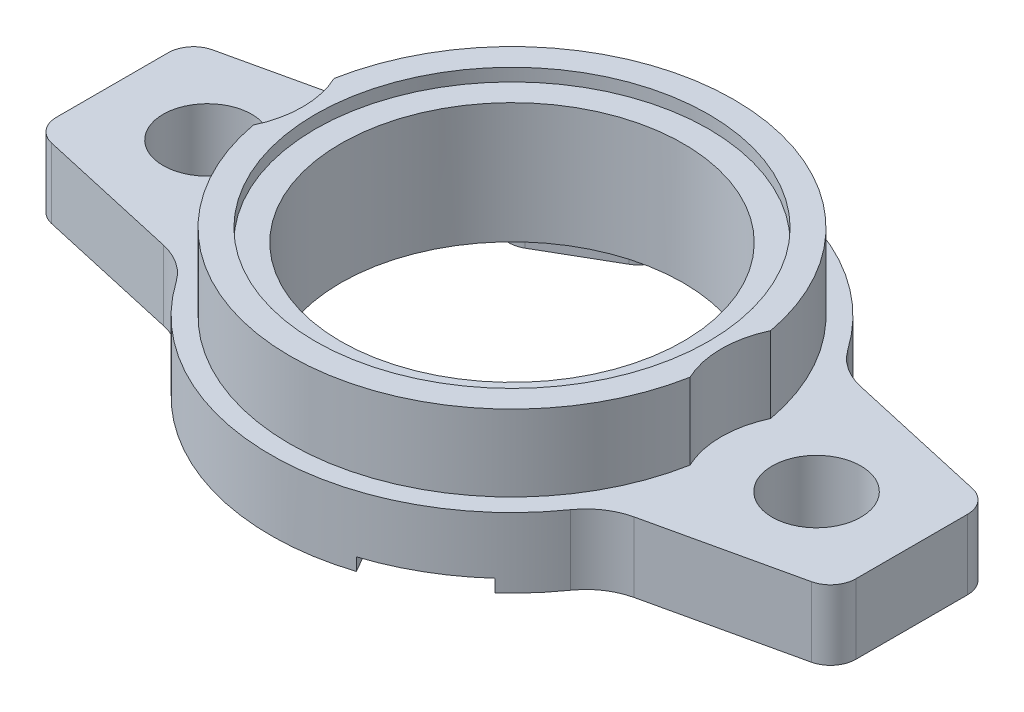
ISO-10303-21;
HEADER;
FILE_DESCRIPTION(('STEP AP214'),'2;1');
FILE_NAME('part.step','',(''),(''),'','','');
FILE_SCHEMA(('AUTOMOTIVE_DESIGN { 1 0 10303 214 1 1 1 1 }'));
ENDSEC;
DATA;
#1=APPLICATION_CONTEXT('core data for automotive mechanical design processes');
#2=APPLICATION_PROTOCOL_DEFINITION('international standard','automotive_design',2000,#1);
#3=PRODUCT_CONTEXT('',#1,'mechanical');
#4=PRODUCT('Part','Part','',(#3));
#5=PRODUCT_RELATED_PRODUCT_CATEGORY('part','',(#4));
#6=PRODUCT_DEFINITION_FORMATION('','',#4);
#7=PRODUCT_DEFINITION_CONTEXT('part definition',#1,'design');
#8=PRODUCT_DEFINITION('design','',#6,#7);
#9=PRODUCT_DEFINITION_SHAPE('','',#8);
#10=(LENGTH_UNIT() NAMED_UNIT(*) SI_UNIT(.MILLI.,.METRE.));
#11=(NAMED_UNIT(*) PLANE_ANGLE_UNIT() SI_UNIT($,.RADIAN.));
#12=(NAMED_UNIT(*) SI_UNIT($,.STERADIAN.) SOLID_ANGLE_UNIT());
#13=UNCERTAINTY_MEASURE_WITH_UNIT(LENGTH_MEASURE(1.E-05),#10,'distance_accuracy_value','');
#14=(GEOMETRIC_REPRESENTATION_CONTEXT(3) GLOBAL_UNCERTAINTY_ASSIGNED_CONTEXT((#13)) GLOBAL_UNIT_ASSIGNED_CONTEXT((#10,
#11,#12)) REPRESENTATION_CONTEXT('',''));
#15=CARTESIAN_POINT('',(0.,0.,0.));
#16=DIRECTION('',(0.,0.,1.));
#17=DIRECTION('',(1.,0.,0.));
#18=AXIS2_PLACEMENT_3D('',#15,#16,#17);
#19=CARTESIAN_POINT('',(0.,0.,0.));
#20=DIRECTION('',(0.,1.,0.));
#21=DIRECTION('',(0.,0.,1.));
#22=AXIS2_PLACEMENT_3D('',#19,#20,#21);
#23=PLANE('',#22);
#24=CARTESIAN_POINT('',(-24.,0.,0.));
#25=DIRECTION('',(0.,1.,0.));
#26=DIRECTION('',(0.,0.,1.));
#27=AXIS2_PLACEMENT_3D('',#24,#25,#26);
#28=CIRCLE('',#27,3.5);
#29=CARTESIAN_POINT('',(-24.,0.,3.5));
#30=VERTEX_POINT('',#29);
#31=EDGE_CURVE('E925',#30,#30,#28,.T.);
#32=ORIENTED_EDGE('',*,*,#31,.T.);
#33=EDGE_LOOP('',(#32));
#34=FACE_BOUND('',#33,.T.);
#35=CARTESIAN_POINT('',(24.,0.,0.));
#36=DIRECTION('',(0.,1.,0.));
#37=DIRECTION('',(0.,0.,1.));
#38=AXIS2_PLACEMENT_3D('',#35,#36,#37);
#39=CIRCLE('',#38,3.50000000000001);
#40=CARTESIAN_POINT('',(24.,0.,3.50000000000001));
#41=VERTEX_POINT('',#40);
#42=EDGE_CURVE('E929',#41,#41,#39,.F.);
#43=ORIENTED_EDGE('',*,*,#42,.F.);
#44=EDGE_LOOP('',(#43));
#45=FACE_BOUND('',#44,.T.);
#46=CARTESIAN_POINT('',(24.,0.,0.));
#47=DIRECTION('',(0.,1.,0.));
#48=DIRECTION('',(0.,0.,-1.));
#49=AXIS2_PLACEMENT_3D('',#46,#47,#48);
#50=CIRCLE('',#49,4.5);
#51=CARTESIAN_POINT('',(21.2420163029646,0.,-3.5557736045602));
#52=VERTEX_POINT('',#51);
#53=CARTESIAN_POINT('',(21.2420163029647,0.,3.55577360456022));
#54=VERTEX_POINT('',#53);
#55=EDGE_CURVE('E601',#52,#54,#50,.T.);
#56=ORIENTED_EDGE('',*,*,#55,.F.);
#57=CARTESIAN_POINT('',(20.629131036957,0.,-4.34594551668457));
#58=DIRECTION('',(0.,-1.,0.));
#59=DIRECTION('',(0.,0.,-1.));
#60=AXIS2_PLACEMENT_3D('',#57,#58,#59);
#61=CIRCLE('',#60,0.999999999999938);
#62=CARTESIAN_POINT('',(20.8486432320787,0.,-5.32155527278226));
#63=VERTEX_POINT('',#62);
#64=EDGE_CURVE('E441',#63,#52,#61,.T.);
#65=ORIENTED_EDGE('',*,*,#64,.F.);
#66=DIRECTION('',(0.975609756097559,0.,0.219512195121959));
#67=VECTOR('',#66,1.);
#68=CARTESIAN_POINT('',(20.8486432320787,0.,-5.32155527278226));
#69=LINE('',#68,#67);
#70=CARTESIAN_POINT('',(15.718229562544,0.,-6.47589834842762));
#71=VERTEX_POINT('',#70);
#72=EDGE_CURVE('E506',#71,#63,#69,.T.);
#73=ORIENTED_EDGE('',*,*,#72,.F.);
#74=CARTESIAN_POINT('',(0.,0.,0.));
#75=DIRECTION('',(0.,-1.,0.));
#76=DIRECTION('',(0.,0.,-1.));
#77=AXIS2_PLACEMENT_3D('',#74,#75,#76);
#78=CIRCLE('',#77,17.);
#79=CARTESIAN_POINT('',(-2.58923223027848,0.,-16.8016629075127));
#80=VERTEX_POINT('',#79);
#81=EDGE_CURVE('E685',#80,#71,#78,.T.);
#82=ORIENTED_EDGE('',*,*,#81,.F.);
#83=CARTESIAN_POINT('',(-2.43692445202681,0.,-15.813329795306));
#84=DIRECTION('',(0.,-1.,0.));
#85=DIRECTION('',(0.,0.,-1.));
#86=AXIS2_PLACEMENT_3D('',#83,#84,#85);
#87=CIRCLE('',#86,0.999999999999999);
#88=CARTESIAN_POINT('',(-3.42525756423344,0.,-15.6610220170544));
#89=VERTEX_POINT('',#88);
#90=EDGE_CURVE('E681',#89,#80,#87,.T.);
#91=ORIENTED_EDGE('',*,*,#90,.F.);
#92=CARTESIAN_POINT('',(-5.40192378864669,0.,-15.356406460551));
#93=DIRECTION('',(0.,1.,0.));
#94=DIRECTION('',(0.,0.,1.));
#95=AXIS2_PLACEMENT_3D('',#92,#93,#94);
#96=CIRCLE('',#95,2.);
#97=CARTESIAN_POINT('',(-4.40192378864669,0.,-13.6243556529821));
#98=VERTEX_POINT('',#97);
#99=EDGE_CURVE('E677',#98,#89,#96,.T.);
#100=ORIENTED_EDGE('',*,*,#99,.F.);
#101=DIRECTION('',(0.866025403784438,0.,-0.500000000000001));
#102=VECTOR('',#101,1.);
#103=CARTESIAN_POINT('',(-9.59807621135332,0.,-10.6243556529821));
#104=LINE('',#103,#102);
#105=CARTESIAN_POINT('',(-9.59807621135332,0.,-10.6243556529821));
#106=VERTEX_POINT('',#105);
#107=EDGE_CURVE('E673',#106,#98,#104,.T.);
#108=ORIENTED_EDGE('',*,*,#107,.F.);
#109=CARTESIAN_POINT('',(-10.5980762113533,0.,-12.356406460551));
#110=DIRECTION('',(0.,1.,0.));
#111=DIRECTION('',(0.,0.,1.));
#112=AXIS2_PLACEMENT_3D('',#109,#110,#111);
#113=CIRCLE('',#112,2.);
#114=CARTESIAN_POINT('',(-11.8502141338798,0.,-10.7968710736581));
#115=VERTEX_POINT('',#114);
#116=EDGE_CURVE('E669',#115,#106,#113,.T.);
#117=ORIENTED_EDGE('',*,*,#116,.F.);
#118=CARTESIAN_POINT('',(-12.476283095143,0.,-10.0171033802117));
#119=DIRECTION('',(0.,-1.,0.));
#120=DIRECTION('',(0.,0.,1.));
#121=AXIS2_PLACEMENT_3D('',#118,#119,#120);
#122=CIRCLE('',#121,0.999999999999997);
#123=CARTESIAN_POINT('',(-13.2560507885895,0.,-10.6431723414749));
#124=VERTEX_POINT('',#123);
#125=EDGE_CURVE('E665',#124,#115,#122,.T.);
#126=ORIENTED_EDGE('',*,*,#125,.F.);
#127=CARTESIAN_POINT('',(0.,0.,0.));
#128=DIRECTION('',(0.,-1.,0.));
#129=DIRECTION('',(0.,0.,-1.));
#130=AXIS2_PLACEMENT_3D('',#127,#128,#129);
#131=CIRCLE('',#130,17.);
#132=CARTESIAN_POINT('',(-15.718229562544,0.,-6.47589834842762));
#133=VERTEX_POINT('',#132);
#134=EDGE_CURVE('E661',#133,#124,#131,.T.);
#135=ORIENTED_EDGE('',*,*,#134,.F.);
#136=DIRECTION('',(0.975609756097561,0.,-0.219512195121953));
#137=VECTOR('',#136,1.);
#138=CARTESIAN_POINT('',(-20.8486432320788,0.,-5.32155527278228));
#139=LINE('',#138,#137);
#140=CARTESIAN_POINT('',(-20.8486432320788,0.,-5.32155527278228));
#141=VERTEX_POINT('',#140);
#142=EDGE_CURVE('E657',#141,#133,#139,.T.);
#143=ORIENTED_EDGE('',*,*,#142,.F.);
#144=CARTESIAN_POINT('',(-20.6291310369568,0.,-4.34594551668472));
#145=DIRECTION('',(0.,-1.,0.));
#146=DIRECTION('',(0.,0.,1.));
#147=AXIS2_PLACEMENT_3D('',#144,#145,#146);
#148=CIRCLE('',#147,1.);
#149=CARTESIAN_POINT('',(-21.2420163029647,0.,-3.55577360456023));
#150=VERTEX_POINT('',#149);
#151=EDGE_CURVE('E653',#150,#141,#148,.T.);
#152=ORIENTED_EDGE('',*,*,#151,.F.);
#153=CARTESIAN_POINT('',(-24.,0.,0.));
#154=DIRECTION('',(0.,1.,0.));
#155=DIRECTION('',(0.,0.,-1.));
#156=AXIS2_PLACEMENT_3D('',#153,#154,#155);
#157=CIRCLE('',#156,4.5);
#158=CARTESIAN_POINT('',(-21.2420163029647,0.,3.55577360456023));
#159=VERTEX_POINT('',#158);
#160=EDGE_CURVE('E649',#159,#150,#157,.T.);
#161=ORIENTED_EDGE('',*,*,#160,.F.);
#162=CARTESIAN_POINT('',(-20.6291310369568,0.,4.34594551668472));
#163=DIRECTION('',(0.,-1.,0.));
#164=DIRECTION('',(0.,0.,-1.));
#165=AXIS2_PLACEMENT_3D('',#162,#163,#164);
#166=CIRCLE('',#165,1.);
#167=CARTESIAN_POINT('',(-20.8486432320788,0.,5.32155527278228));
#168=VERTEX_POINT('',#167);
#169=EDGE_CURVE('E645',#168,#159,#166,.T.);
#170=ORIENTED_EDGE('',*,*,#169,.F.);
#171=DIRECTION('',(-0.975609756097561,0.,-0.219512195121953));
#172=VECTOR('',#171,1.);
#173=CARTESIAN_POINT('',(-20.8486432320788,0.,5.32155527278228));
#174=LINE('',#173,#172);
#175=CARTESIAN_POINT('',(-15.718229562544,0.,6.47589834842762));
#176=VERTEX_POINT('',#175);
#177=EDGE_CURVE('E641',#176,#168,#174,.T.);
#178=ORIENTED_EDGE('',*,*,#177,.F.);
#179=CARTESIAN_POINT('',(0.,0.,0.));
#180=DIRECTION('',(0.,-1.,0.));
#181=DIRECTION('',(0.,0.,-1.));
#182=AXIS2_PLACEMENT_3D('',#179,#180,#181);
#183=CIRCLE('',#182,17.);
#184=CARTESIAN_POINT('',(2.58923223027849,0.,16.8016629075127));
#185=VERTEX_POINT('',#184);
#186=EDGE_CURVE('E637',#185,#176,#183,.T.);
#187=ORIENTED_EDGE('',*,*,#186,.F.);
#188=CARTESIAN_POINT('',(2.43692445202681,0.,15.813329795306));
#189=DIRECTION('',(0.,-1.,0.));
#190=DIRECTION('',(0.,0.,-1.));
#191=AXIS2_PLACEMENT_3D('',#188,#189,#190);
#192=CIRCLE('',#191,1.);
#193=CARTESIAN_POINT('',(3.42525756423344,0.,15.6610220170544));
#194=VERTEX_POINT('',#193);
#195=EDGE_CURVE('E633',#194,#185,#192,.T.);
#196=ORIENTED_EDGE('',*,*,#195,.F.);
#197=CARTESIAN_POINT('',(5.40192378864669,0.,15.356406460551));
#198=DIRECTION('',(0.,1.,0.));
#199=DIRECTION('',(0.,0.,-1.));
#200=AXIS2_PLACEMENT_3D('',#197,#198,#199);
#201=CIRCLE('',#200,2.);
#202=CARTESIAN_POINT('',(4.40192378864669,0.,13.6243556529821));
#203=VERTEX_POINT('',#202);
#204=EDGE_CURVE('E629',#203,#194,#201,.T.);
#205=ORIENTED_EDGE('',*,*,#204,.F.);
#206=DIRECTION('',(-0.866025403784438,0.,0.500000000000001));
#207=VECTOR('',#206,1.);
#208=CARTESIAN_POINT('',(4.40192378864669,0.,13.6243556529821));
#209=LINE('',#208,#207);
#210=CARTESIAN_POINT('',(9.59807621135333,0.,10.6243556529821));
#211=VERTEX_POINT('',#210);
#212=EDGE_CURVE('E625',#211,#203,#209,.T.);
#213=ORIENTED_EDGE('',*,*,#212,.F.);
#214=CARTESIAN_POINT('',(10.5980762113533,0.,12.356406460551));
#215=DIRECTION('',(0.,1.,0.));
#216=DIRECTION('',(0.,0.,-1.));
#217=AXIS2_PLACEMENT_3D('',#214,#215,#216);
#218=CIRCLE('',#217,1.99999999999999);
#219=CARTESIAN_POINT('',(11.8502141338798,0.,10.7968710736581));
#220=VERTEX_POINT('',#219);
#221=EDGE_CURVE('E621',#220,#211,#218,.T.);
#222=ORIENTED_EDGE('',*,*,#221,.F.);
#223=CARTESIAN_POINT('',(12.476283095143,0.,10.0171033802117));
#224=DIRECTION('',(0.,-1.,0.));
#225=DIRECTION('',(0.,0.,1.));
#226=AXIS2_PLACEMENT_3D('',#223,#224,#225);
#227=CIRCLE('',#226,1.);
#228=CARTESIAN_POINT('',(13.2560507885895,0.,10.6431723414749));
#229=VERTEX_POINT('',#228);
#230=EDGE_CURVE('E617',#229,#220,#227,.T.);
#231=ORIENTED_EDGE('',*,*,#230,.F.);
#232=CARTESIAN_POINT('',(0.,0.,0.));
#233=DIRECTION('',(0.,-1.,0.));
#234=DIRECTION('',(0.,0.,-1.));
#235=AXIS2_PLACEMENT_3D('',#232,#233,#234);
#236=CIRCLE('',#235,17.);
#237=CARTESIAN_POINT('',(15.718229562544,0.,6.47589834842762));
#238=VERTEX_POINT('',#237);
#239=EDGE_CURVE('E613',#238,#229,#236,.T.);
#240=ORIENTED_EDGE('',*,*,#239,.F.);
#241=DIRECTION('',(-0.97560975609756,0.,0.219512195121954));
#242=VECTOR('',#241,1.);
#243=CARTESIAN_POINT('',(20.8486432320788,0.,5.32155527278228));
#244=LINE('',#243,#242);
#245=CARTESIAN_POINT('',(20.8486432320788,0.,5.32155527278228));
#246=VERTEX_POINT('',#245);
#247=EDGE_CURVE('E609',#246,#238,#244,.T.);
#248=ORIENTED_EDGE('',*,*,#247,.F.);
#249=CARTESIAN_POINT('',(20.6291310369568,0.,4.34594551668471));
#250=DIRECTION('',(0.,-1.,0.));
#251=DIRECTION('',(0.,0.,1.));
#252=AXIS2_PLACEMENT_3D('',#249,#250,#251);
#253=CIRCLE('',#252,1.);
#254=EDGE_CURVE('E605',#54,#246,#253,.T.);
#255=ORIENTED_EDGE('',*,*,#254,.F.);
#256=EDGE_LOOP('',(#56,#65,#73,#82,#91,#100,#108,#117,#126,#135,#143,#152,#161,#170,#178,#187,
#196,#205,#213,#222,#231,#240,#248,#255));
#257=FACE_BOUND('',#256,.T.);
#258=CARTESIAN_POINT('',(-5.40192378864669,0.,-15.356406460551));
#259=DIRECTION('',(0.,-1.,0.));
#260=DIRECTION('',(0.,0.,1.));
#261=AXIS2_PLACEMENT_3D('',#258,#259,#260);
#262=CIRCLE('',#261,0.999999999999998);
#263=CARTESIAN_POINT('',(-4.53589838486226,0.,-15.856406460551));
#264=VERTEX_POINT('',#263);
#265=CARTESIAN_POINT('',(-4.90192378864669,0.,-14.4903810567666));
#266=VERTEX_POINT('',#265);
#267=EDGE_CURVE('E474',#264,#266,#262,.T.);
#268=ORIENTED_EDGE('',*,*,#267,.F.);
#269=DIRECTION('',(-0.5,0.,-0.866025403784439));
#270=VECTOR('',#269,1.);
#271=CARTESIAN_POINT('',(3.46410161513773,0.,-1.99999999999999));
#272=LINE('',#271,#270);
#273=CARTESIAN_POINT('',(-5.82298619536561,0.,-18.0857079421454));
#274=VERTEX_POINT('',#273);
#275=EDGE_CURVE('E964',#264,#274,#272,.T.);
#276=ORIENTED_EDGE('',*,*,#275,.T.);
#277=CARTESIAN_POINT('',(0.,0.,0.));
#278=DIRECTION('',(0.,1.,0.));
#279=DIRECTION('',(0.,0.,1.));
#280=AXIS2_PLACEMENT_3D('',#277,#278,#279);
#281=CIRCLE('',#280,19.);
#282=CARTESIAN_POINT('',(15.548566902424,0.,-10.9198016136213));
#283=VERTEX_POINT('',#282);
#284=EDGE_CURVE('E900',#283,#274,#281,.T.);
#285=ORIENTED_EDGE('',*,*,#284,.F.);
#286=CARTESIAN_POINT('',(19.6402950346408,0.,-13.7934336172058));
#287=DIRECTION('',(0.,1.,0.));
#288=DIRECTION('',(0.,0.,1.));
#289=AXIS2_PLACEMENT_3D('',#286,#287,#288);
#290=CIRCLE('',#289,5.);
#291=CARTESIAN_POINT('',(18.542734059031,0.,-8.91538483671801));
#292=VERTEX_POINT('',#291);
#293=EDGE_CURVE('E1002',#283,#292,#290,.T.);
#294=ORIENTED_EDGE('',*,*,#293,.T.);
#295=DIRECTION('',(-0.975609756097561,0.,-0.219512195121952));
#296=VECTOR('',#295,1.);
#297=CARTESIAN_POINT('',(2.80279595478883,0.,-12.4568709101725));
#298=LINE('',#297,#296);
#299=CARTESIAN_POINT('',(29.9390243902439,0.,-6.35121951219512));
#300=VERTEX_POINT('',#299);
#301=EDGE_CURVE('E917',#300,#292,#298,.T.);
#302=ORIENTED_EDGE('',*,*,#301,.F.);
#303=CARTESIAN_POINT('',(29.5,0.,-4.4));
#304=DIRECTION('',(0.,1.,0.));
#305=DIRECTION('',(0.,0.,1.));
#306=AXIS2_PLACEMENT_3D('',#303,#304,#305);
#307=CIRCLE('',#306,1.99999999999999);
#308=CARTESIAN_POINT('',(31.5,0.,-4.4));
#309=VERTEX_POINT('',#308);
#310=EDGE_CURVE('E913',#309,#300,#307,.T.);
#311=ORIENTED_EDGE('',*,*,#310,.F.);
#312=DIRECTION('',(0.,0.,1.));
#313=VECTOR('',#312,1.);
#314=CARTESIAN_POINT('',(31.5,0.,-2.48380861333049E-13));
#315=LINE('',#314,#313);
#316=CARTESIAN_POINT('',(31.5,0.,4.39999999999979));
#317=VERTEX_POINT('',#316);
#318=EDGE_CURVE('E909',#309,#317,#315,.T.);
#319=ORIENTED_EDGE('',*,*,#318,.T.);
#320=CARTESIAN_POINT('',(29.5,0.,4.39999999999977));
#321=DIRECTION('',(0.,1.,0.));
#322=DIRECTION('',(0.,0.,1.));
#323=AXIS2_PLACEMENT_3D('',#320,#321,#322);
#324=CIRCLE('',#323,2.);
#325=CARTESIAN_POINT('',(29.939024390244,0.,6.35121951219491));
#326=VERTEX_POINT('',#325);
#327=EDGE_CURVE('E905',#317,#326,#324,.F.);
#328=ORIENTED_EDGE('',*,*,#327,.T.);
#329=DIRECTION('',(-0.975609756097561,0.,0.219512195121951));
#330=VECTOR('',#329,1.);
#331=CARTESIAN_POINT('',(2.80279595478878,0.,12.4568709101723));
#332=LINE('',#331,#330);
#333=CARTESIAN_POINT('',(18.5427340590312,0.,8.91538483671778));
#334=VERTEX_POINT('',#333);
#335=EDGE_CURVE('E899',#326,#334,#332,.T.);
#336=ORIENTED_EDGE('',*,*,#335,.T.);
#337=CARTESIAN_POINT('',(19.640295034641,0.,13.7934336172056));
#338=DIRECTION('',(0.,1.,0.));
#339=DIRECTION('',(0.,0.,1.));
#340=AXIS2_PLACEMENT_3D('',#337,#338,#339);
#341=CIRCLE('',#340,5.);
#342=CARTESIAN_POINT('',(15.5485669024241,0.,10.9198016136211));
#343=VERTEX_POINT('',#342);
#344=EDGE_CURVE('E55',#334,#343,#341,.T.);
#345=ORIENTED_EDGE('',*,*,#344,.T.);
#346=CARTESIAN_POINT('',(12.7511894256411,0.,14.0857079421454));
#347=VERTEX_POINT('',#346);
#348=EDGE_CURVE('E426',#347,#343,#281,.T.);
#349=ORIENTED_EDGE('',*,*,#348,.F.);
#350=DIRECTION('',(0.500000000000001,0.,0.866025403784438));
#351=VECTOR('',#350,1.);
#352=CARTESIAN_POINT('',(12.9641016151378,0.,14.4544826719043));
#353=LINE('',#352,#351);
#354=CARTESIAN_POINT('',(11.4641016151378,0.,11.856406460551));
#355=VERTEX_POINT('',#354);
#356=EDGE_CURVE('E403',#355,#347,#353,.T.);
#357=ORIENTED_EDGE('',*,*,#356,.F.);
#358=CARTESIAN_POINT('',(10.5980762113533,0.,12.356406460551));
#359=DIRECTION('',(0.,-1.,0.));
#360=DIRECTION('',(0.,0.,-1.));
#361=AXIS2_PLACEMENT_3D('',#358,#359,#360);
#362=CIRCLE('',#361,0.999999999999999);
#363=CARTESIAN_POINT('',(10.0980762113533,0.,11.4903810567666));
#364=VERTEX_POINT('',#363);
#365=EDGE_CURVE('E415',#364,#355,#362,.T.);
#366=ORIENTED_EDGE('',*,*,#365,.F.);
#367=DIRECTION('',(0.866025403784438,0.,-0.500000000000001));
#368=VECTOR('',#367,1.);
#369=CARTESIAN_POINT('',(4.9019237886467,0.,14.4903810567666));
#370=LINE('',#369,#368);
#371=CARTESIAN_POINT('',(4.9019237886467,0.,14.4903810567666));
#372=VERTEX_POINT('',#371);
#373=EDGE_CURVE('E421',#372,#364,#370,.T.);
#374=ORIENTED_EDGE('',*,*,#373,.F.);
#375=CARTESIAN_POINT('',(5.4019237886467,0.,15.356406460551));
#376=DIRECTION('',(0.,-1.,0.));
#377=DIRECTION('',(0.,0.,-1.));
#378=AXIS2_PLACEMENT_3D('',#375,#376,#377);
#379=CIRCLE('',#378,0.999999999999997);
#380=CARTESIAN_POINT('',(4.53589838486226,0.,15.856406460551));
#381=VERTEX_POINT('',#380);
#382=EDGE_CURVE('E437',#381,#372,#379,.T.);
#383=ORIENTED_EDGE('',*,*,#382,.F.);
#384=DIRECTION('',(0.499999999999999,0.,0.866025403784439));
#385=VECTOR('',#384,1.);
#386=CARTESIAN_POINT('',(-3.46410161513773,0.,1.99999999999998));
#387=LINE('',#386,#385);
#388=CARTESIAN_POINT('',(5.82298619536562,0.,18.0857079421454));
#389=VERTEX_POINT('',#388);
#390=EDGE_CURVE('E957',#381,#389,#387,.T.);
#391=ORIENTED_EDGE('',*,*,#390,.T.);
#392=CARTESIAN_POINT('',(-15.548566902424,0.,10.9198016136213));
#393=VERTEX_POINT('',#392);
#394=EDGE_CURVE('E896',#393,#389,#281,.T.);
#395=ORIENTED_EDGE('',*,*,#394,.F.);
#396=CARTESIAN_POINT('',(-19.6402950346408,0.,13.7934336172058));
#397=DIRECTION('',(0.,1.,0.));
#398=DIRECTION('',(0.,0.,1.));
#399=AXIS2_PLACEMENT_3D('',#396,#397,#398);
#400=CIRCLE('',#399,5.);
#401=CARTESIAN_POINT('',(-18.542734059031,0.,8.91538483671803));
#402=VERTEX_POINT('',#401);
#403=EDGE_CURVE('E1014',#393,#402,#400,.T.);
#404=ORIENTED_EDGE('',*,*,#403,.T.);
#405=DIRECTION('',(0.975609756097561,0.,0.219512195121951));
#406=VECTOR('',#405,1.);
#407=CARTESIAN_POINT('',(-2.80279595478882,0.,12.4568709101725));
#408=LINE('',#407,#406);
#409=CARTESIAN_POINT('',(-29.9390243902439,0.,6.35121951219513));
#410=VERTEX_POINT('',#409);
#411=EDGE_CURVE('E892',#410,#402,#408,.T.);
#412=ORIENTED_EDGE('',*,*,#411,.F.);
#413=CARTESIAN_POINT('',(-29.5,0.,4.4));
#414=DIRECTION('',(0.,1.,0.));
#415=DIRECTION('',(0.,0.,1.));
#416=AXIS2_PLACEMENT_3D('',#413,#414,#415);
#417=CIRCLE('',#416,2.00000000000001);
#418=CARTESIAN_POINT('',(-31.5,0.,4.40000000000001));
#419=VERTEX_POINT('',#418);
#420=EDGE_CURVE('E888',#419,#410,#417,.T.);
#421=ORIENTED_EDGE('',*,*,#420,.F.);
#422=DIRECTION('',(0.,0.,1.));
#423=VECTOR('',#422,1.);
#424=CARTESIAN_POINT('',(-31.5,0.,0.));
#425=LINE('',#424,#423);
#426=CARTESIAN_POINT('',(-31.5,0.,-4.4));
#427=VERTEX_POINT('',#426);
#428=EDGE_CURVE('E884',#427,#419,#425,.T.);
#429=ORIENTED_EDGE('',*,*,#428,.F.);
#430=CARTESIAN_POINT('',(-29.5,0.,-4.4));
#431=DIRECTION('',(0.,1.,0.));
#432=DIRECTION('',(0.,0.,1.));
#433=AXIS2_PLACEMENT_3D('',#430,#431,#432);
#434=CIRCLE('',#433,2.);
#435=CARTESIAN_POINT('',(-29.9390243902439,0.,-6.35121951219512));
#436=VERTEX_POINT('',#435);
#437=EDGE_CURVE('E880',#427,#436,#434,.F.);
#438=ORIENTED_EDGE('',*,*,#437,.T.);
#439=DIRECTION('',(0.975609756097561,0.,-0.219512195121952));
#440=VECTOR('',#439,1.);
#441=CARTESIAN_POINT('',(-2.80279595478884,0.,-12.4568709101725));
#442=LINE('',#441,#440);
#443=CARTESIAN_POINT('',(-18.542734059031,0.,-8.91538483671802));
#444=VERTEX_POINT('',#443);
#445=EDGE_CURVE('E921',#436,#444,#442,.T.);
#446=ORIENTED_EDGE('',*,*,#445,.T.);
#447=CARTESIAN_POINT('',(-19.6402950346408,0.,-13.7934336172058));
#448=DIRECTION('',(0.,1.,0.));
#449=DIRECTION('',(0.,0.,1.));
#450=AXIS2_PLACEMENT_3D('',#447,#448,#449);
#451=CIRCLE('',#450,5.);
#452=CARTESIAN_POINT('',(-15.548566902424,0.,-10.9198016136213));
#453=VERTEX_POINT('',#452);
#454=EDGE_CURVE('E1008',#444,#453,#451,.T.);
#455=ORIENTED_EDGE('',*,*,#454,.T.);
#456=CARTESIAN_POINT('',(-12.7511894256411,0.,-14.0857079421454));
#457=VERTEX_POINT('',#456);
#458=EDGE_CURVE('E901',#457,#453,#281,.T.);
#459=ORIENTED_EDGE('',*,*,#458,.F.);
#460=DIRECTION('',(-0.499999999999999,0.,-0.866025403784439));
#461=VECTOR('',#460,1.);
#462=CARTESIAN_POINT('',(-12.9641016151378,0.,-14.4544826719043));
#463=LINE('',#462,#461);
#464=CARTESIAN_POINT('',(-11.4641016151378,0.,-11.856406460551));
#465=VERTEX_POINT('',#464);
#466=EDGE_CURVE('E479',#465,#457,#463,.T.);
#467=ORIENTED_EDGE('',*,*,#466,.F.);
#468=CARTESIAN_POINT('',(-10.5980762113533,0.,-12.356406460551));
#469=DIRECTION('',(0.,-1.,0.));
#470=DIRECTION('',(0.,0.,1.));
#471=AXIS2_PLACEMENT_3D('',#468,#469,#470);
#472=CIRCLE('',#471,1.);
#473=CARTESIAN_POINT('',(-10.0980762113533,0.,-11.4903810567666));
#474=VERTEX_POINT('',#473);
#475=EDGE_CURVE('E412',#474,#465,#472,.T.);
#476=ORIENTED_EDGE('',*,*,#475,.F.);
#477=DIRECTION('',(-0.866025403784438,0.,0.500000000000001));
#478=VECTOR('',#477,1.);
#479=CARTESIAN_POINT('',(-10.0980762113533,0.,-11.4903810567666));
#480=LINE('',#479,#478);
#481=EDGE_CURVE('E470',#266,#474,#480,.T.);
#482=ORIENTED_EDGE('',*,*,#481,.F.);
#483=EDGE_LOOP('',(#268,#276,#285,#294,#302,#311,#319,#328,#336,#345,#349,#357,#366,#374,#383,
#391,#395,#404,#412,#421,#429,#438,#446,#455,#459,#467,#476,#482));
#484=FACE_BOUND('',#483,.T.);
#485=ADVANCED_FACE('F45',(#34,#45,#257,#484),#23,.F.);
#486=CARTESIAN_POINT('',(-29.5,11.5,-4.4));
#487=DIRECTION('',(0.,-1.,0.));
#488=DIRECTION('',(0.,0.,-1.));
#489=AXIS2_PLACEMENT_3D('',#486,#487,#488);
#490=CYLINDRICAL_SURFACE('',#489,2.);
#491=DIRECTION('',(0.,-1.,0.));
#492=VECTOR('',#491,1.);
#493=CARTESIAN_POINT('',(-31.5,11.5,-4.4));
#494=LINE('',#493,#492);
#495=CARTESIAN_POINT('',(-31.5,5.5,-4.4));
#496=VERTEX_POINT('',#495);
#497=EDGE_CURVE('E954',#496,#427,#494,.T.);
#498=ORIENTED_EDGE('',*,*,#497,.F.);
#499=CARTESIAN_POINT('',(-29.5,5.5,-4.4));
#500=DIRECTION('',(0.,1.,0.));
#501=DIRECTION('',(0.,0.,1.));
#502=AXIS2_PLACEMENT_3D('',#499,#500,#501);
#503=CIRCLE('',#502,2.);
#504=CARTESIAN_POINT('',(-29.9390243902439,5.5,-6.35121951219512));
#505=VERTEX_POINT('',#504);
#506=EDGE_CURVE('E872',#496,#505,#503,.F.);
#507=ORIENTED_EDGE('',*,*,#506,.T.);
#508=DIRECTION('',(0.,-1.,0.));
#509=VECTOR('',#508,1.);
#510=CARTESIAN_POINT('',(-29.9390243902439,11.5,-6.35121951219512));
#511=LINE('',#510,#509);
#512=EDGE_CURVE('E933',#505,#436,#511,.T.);
#513=ORIENTED_EDGE('',*,*,#512,.T.);
#514=ORIENTED_EDGE('',*,*,#437,.F.);
#515=EDGE_LOOP('',(#498,#507,#513,#514));
#516=FACE_BOUND('',#515,.T.);
#517=ADVANCED_FACE('F1075',(#516),#490,.T.);
#518=CARTESIAN_POINT('',(-31.5,11.5,0.));
#519=DIRECTION('',(1.,0.,0.));
#520=DIRECTION('',(0.,0.,-1.));
#521=AXIS2_PLACEMENT_3D('',#518,#519,#520);
#522=PLANE('',#521);
#523=DIRECTION('',(0.,0.,1.));
#524=VECTOR('',#523,1.);
#525=CARTESIAN_POINT('',(-31.5,5.5,0.));
#526=LINE('',#525,#524);
#527=CARTESIAN_POINT('',(-31.5,5.5,4.40000000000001));
#528=VERTEX_POINT('',#527);
#529=EDGE_CURVE('E869',#496,#528,#526,.T.);
#530=ORIENTED_EDGE('',*,*,#529,.F.);
#531=ORIENTED_EDGE('',*,*,#497,.T.);
#532=ORIENTED_EDGE('',*,*,#428,.T.);
#533=DIRECTION('',(0.,-1.,0.));
#534=VECTOR('',#533,1.);
#535=CARTESIAN_POINT('',(-31.5,11.5,4.40000000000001));
#536=LINE('',#535,#534);
#537=EDGE_CURVE('E951',#528,#419,#536,.T.);
#538=ORIENTED_EDGE('',*,*,#537,.F.);
#539=EDGE_LOOP('',(#530,#531,#532,#538));
#540=FACE_BOUND('',#539,.T.);
#541=ADVANCED_FACE('F1082',(#540),#522,.F.);
#542=CARTESIAN_POINT('',(-29.5,11.5,4.4));
#543=DIRECTION('',(0.,-1.,0.));
#544=DIRECTION('',(0.,0.,-1.));
#545=AXIS2_PLACEMENT_3D('',#542,#543,#544);
#546=CYLINDRICAL_SURFACE('',#545,2.00000000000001);
#547=CARTESIAN_POINT('',(-29.5,5.5,4.4));
#548=DIRECTION('',(0.,1.,0.));
#549=DIRECTION('',(0.,0.,1.));
#550=AXIS2_PLACEMENT_3D('',#547,#548,#549);
#551=CIRCLE('',#550,2.00000000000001);
#552=CARTESIAN_POINT('',(-29.9390243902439,5.5,6.35121951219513));
#553=VERTEX_POINT('',#552);
#554=EDGE_CURVE('E866',#528,#553,#551,.T.);
#555=ORIENTED_EDGE('',*,*,#554,.F.);
#556=ORIENTED_EDGE('',*,*,#537,.T.);
#557=ORIENTED_EDGE('',*,*,#420,.T.);
#558=DIRECTION('',(0.,-1.,0.));
#559=VECTOR('',#558,1.);
#560=CARTESIAN_POINT('',(-29.9390243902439,11.5,6.35121951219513));
#561=LINE('',#560,#559);
#562=EDGE_CURVE('E948',#553,#410,#561,.T.);
#563=ORIENTED_EDGE('',*,*,#562,.F.);
#564=EDGE_LOOP('',(#555,#556,#557,#563));
#565=FACE_BOUND('',#564,.T.);
#566=ADVANCED_FACE('F1087',(#565),#546,.T.);
#567=CARTESIAN_POINT('',(-2.80279595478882,11.5,12.4568709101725));
#568=DIRECTION('',(0.219512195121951,0.,-0.975609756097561));
#569=DIRECTION('',(-0.975609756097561,0.,-0.219512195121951));
#570=AXIS2_PLACEMENT_3D('',#567,#568,#569);
#571=PLANE('',#570);
#572=ORIENTED_EDGE('',*,*,#411,.T.);
#573=DIRECTION('',(0.,1.,0.));
#574=VECTOR('',#573,1.);
#575=CARTESIAN_POINT('',(-18.542734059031,5.5,8.91538483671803));
#576=LINE('',#575,#574);
#577=CARTESIAN_POINT('',(-18.542734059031,5.5,8.91538483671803));
#578=VERTEX_POINT('',#577);
#579=EDGE_CURVE('E996',#402,#578,#576,.T.);
#580=ORIENTED_EDGE('',*,*,#579,.T.);
#581=DIRECTION('',(0.975609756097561,0.,0.219512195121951));
#582=VECTOR('',#581,1.);
#583=CARTESIAN_POINT('',(-2.80279595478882,5.5,12.4568709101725));
#584=LINE('',#583,#582);
#585=EDGE_CURVE('E862',#553,#578,#584,.T.);
#586=ORIENTED_EDGE('',*,*,#585,.F.);
#587=ORIENTED_EDGE('',*,*,#562,.T.);
#588=EDGE_LOOP('',(#572,#580,#586,#587));
#589=FACE_BOUND('',#588,.T.);
#590=ADVANCED_FACE('F1089',(#589),#571,.F.);
#591=CARTESIAN_POINT('',(0.,11.5,0.));
#592=DIRECTION('',(0.,-1.,0.));
#593=DIRECTION('',(0.,0.,-1.));
#594=AXIS2_PLACEMENT_3D('',#591,#592,#593);
#595=CYLINDRICAL_SURFACE('',#594,19.);
#596=CARTESIAN_POINT('',(0.,5.5,0.));
#597=DIRECTION('',(0.,1.,0.));
#598=DIRECTION('',(0.,0.,1.));
#599=AXIS2_PLACEMENT_3D('',#596,#597,#598);
#600=CIRCLE('',#599,19.);
#601=CARTESIAN_POINT('',(-15.548566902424,5.5,10.9198016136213));
#602=VERTEX_POINT('',#601);
#603=CARTESIAN_POINT('',(15.5485669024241,5.5,10.9198016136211));
#604=VERTEX_POINT('',#603);
#605=EDGE_CURVE('E859',#602,#604,#600,.T.);
#606=ORIENTED_EDGE('',*,*,#605,.F.);
#607=DIRECTION('',(0.,-1.,0.));
#608=VECTOR('',#607,1.);
#609=CARTESIAN_POINT('',(-15.548566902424,11.5,10.9198016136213));
#610=LINE('',#609,#608);
#611=EDGE_CURVE('E992',#602,#393,#610,.T.);
#612=ORIENTED_EDGE('',*,*,#611,.T.);
#613=ORIENTED_EDGE('',*,*,#394,.T.);
#614=DIRECTION('',(0.,-1.,0.));
#615=VECTOR('',#614,1.);
#616=CARTESIAN_POINT('',(5.82298619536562,11.5,18.0857079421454));
#617=LINE('',#616,#615);
#618=CARTESIAN_POINT('',(5.82298619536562,1.,18.0857079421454));
#619=VERTEX_POINT('',#618);
#620=EDGE_CURVE('E767',#389,#619,#617,.F.);
#621=ORIENTED_EDGE('',*,*,#620,.T.);
#622=CARTESIAN_POINT('',(0.,1.,0.));
#623=DIRECTION('',(0.,-1.,0.));
#624=DIRECTION('',(0.,0.,-1.));
#625=AXIS2_PLACEMENT_3D('',#622,#623,#624);
#626=CIRCLE('',#625,19.);
#627=CARTESIAN_POINT('',(12.7511894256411,1.,14.0857079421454));
#628=VERTEX_POINT('',#627);
#629=EDGE_CURVE('E972',#628,#619,#626,.T.);
#630=ORIENTED_EDGE('',*,*,#629,.F.);
#631=DIRECTION('',(0.,-1.,0.));
#632=VECTOR('',#631,1.);
#633=CARTESIAN_POINT('',(12.7511894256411,11.5,14.0857079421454));
#634=LINE('',#633,#632);
#635=EDGE_CURVE('E695',#628,#347,#634,.T.);
#636=ORIENTED_EDGE('',*,*,#635,.T.);
#637=ORIENTED_EDGE('',*,*,#348,.T.);
#638=DIRECTION('',(0.,-1.,0.));
#639=VECTOR('',#638,1.);
#640=CARTESIAN_POINT('',(15.5485669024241,11.5,10.9198016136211));
#641=LINE('',#640,#639);
#642=EDGE_CURVE('E989',#343,#604,#641,.F.);
#643=ORIENTED_EDGE('',*,*,#642,.T.);
#644=EDGE_LOOP('',(#606,#612,#613,#621,#630,#636,#637,#643));
#645=FACE_BOUND('',#644,.T.);
#646=ADVANCED_FACE('F1024',(#645),#595,.T.);
#647=CARTESIAN_POINT('',(2.80279595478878,11.5,12.4568709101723));
#648=DIRECTION('',(0.219512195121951,0.,0.975609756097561));
#649=DIRECTION('',(0.975609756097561,0.,-0.219512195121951));
#650=AXIS2_PLACEMENT_3D('',#647,#648,#649);
#651=PLANE('',#650);
#652=DIRECTION('',(-0.975609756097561,0.,0.219512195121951));
#653=VECTOR('',#652,1.);
#654=CARTESIAN_POINT('',(2.80279595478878,5.5,12.4568709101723));
#655=LINE('',#654,#653);
#656=CARTESIAN_POINT('',(29.939024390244,5.5,6.35121951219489));
#657=VERTEX_POINT('',#656);
#658=CARTESIAN_POINT('',(18.5427340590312,5.5,8.91538483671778));
#659=VERTEX_POINT('',#658);
#660=EDGE_CURVE('E856',#657,#659,#655,.T.);
#661=ORIENTED_EDGE('',*,*,#660,.T.);
#662=DIRECTION('',(0.,-1.,0.));
#663=VECTOR('',#662,1.);
#664=CARTESIAN_POINT('',(18.5427340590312,11.5,8.91538483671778));
#665=LINE('',#664,#663);
#666=EDGE_CURVE('E999',#659,#334,#665,.T.);
#667=ORIENTED_EDGE('',*,*,#666,.T.);
#668=ORIENTED_EDGE('',*,*,#335,.F.);
#669=DIRECTION('',(0.,-1.,0.));
#670=VECTOR('',#669,1.);
#671=CARTESIAN_POINT('',(29.939024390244,11.5,6.35121951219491));
#672=LINE('',#671,#670);
#673=EDGE_CURVE('E945',#657,#326,#672,.T.);
#674=ORIENTED_EDGE('',*,*,#673,.F.);
#675=EDGE_LOOP('',(#661,#667,#668,#674));
#676=FACE_BOUND('',#675,.T.);
#677=ADVANCED_FACE('F1027',(#676),#651,.T.);
#678=CARTESIAN_POINT('',(29.5,11.5,4.39999999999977));
#679=DIRECTION('',(0.,-1.,0.));
#680=DIRECTION('',(0.,0.,-1.));
#681=AXIS2_PLACEMENT_3D('',#678,#679,#680);
#682=CYLINDRICAL_SURFACE('',#681,2.);
#683=DIRECTION('',(0.,-1.,0.));
#684=VECTOR('',#683,1.);
#685=CARTESIAN_POINT('',(31.5,11.5,4.39999999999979));
#686=LINE('',#685,#684);
#687=CARTESIAN_POINT('',(31.5,5.5,4.39999999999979));
#688=VERTEX_POINT('',#687);
#689=EDGE_CURVE('E942',#688,#317,#686,.T.);
#690=ORIENTED_EDGE('',*,*,#689,.F.);
#691=CARTESIAN_POINT('',(29.5,5.5,4.39999999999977));
#692=DIRECTION('',(0.,1.,0.));
#693=DIRECTION('',(0.,0.,1.));
#694=AXIS2_PLACEMENT_3D('',#691,#692,#693);
#695=CIRCLE('',#694,2.);
#696=EDGE_CURVE('E852',#688,#657,#695,.F.);
#697=ORIENTED_EDGE('',*,*,#696,.T.);
#698=ORIENTED_EDGE('',*,*,#673,.T.);
#699=ORIENTED_EDGE('',*,*,#327,.F.);
#700=EDGE_LOOP('',(#690,#697,#698,#699));
#701=FACE_BOUND('',#700,.T.);
#702=ADVANCED_FACE('F1033',(#701),#682,.T.);
#703=CARTESIAN_POINT('',(31.5,11.5,-2.48380861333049E-13));
#704=DIRECTION('',(1.,0.,0.));
#705=DIRECTION('',(0.,0.,-1.));
#706=AXIS2_PLACEMENT_3D('',#703,#704,#705);
#707=PLANE('',#706);
#708=DIRECTION('',(0.,-1.,0.));
#709=VECTOR('',#708,1.);
#710=CARTESIAN_POINT('',(31.5,11.5,-4.4));
#711=LINE('',#710,#709);
#712=CARTESIAN_POINT('',(31.5,5.5,-4.4));
#713=VERTEX_POINT('',#712);
#714=EDGE_CURVE('E939',#713,#309,#711,.T.);
#715=ORIENTED_EDGE('',*,*,#714,.F.);
#716=DIRECTION('',(0.,0.,1.));
#717=VECTOR('',#716,1.);
#718=CARTESIAN_POINT('',(31.5,5.5,-2.48380861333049E-13));
#719=LINE('',#718,#717);
#720=EDGE_CURVE('E848',#713,#688,#719,.T.);
#721=ORIENTED_EDGE('',*,*,#720,.T.);
#722=ORIENTED_EDGE('',*,*,#689,.T.);
#723=ORIENTED_EDGE('',*,*,#318,.F.);
#724=EDGE_LOOP('',(#715,#721,#722,#723));
#725=FACE_BOUND('',#724,.T.);
#726=ADVANCED_FACE('F1038',(#725),#707,.T.);
#727=CARTESIAN_POINT('',(29.5,11.5,-4.4));
#728=DIRECTION('',(0.,-1.,0.));
#729=DIRECTION('',(0.,0.,-1.));
#730=AXIS2_PLACEMENT_3D('',#727,#728,#729);
#731=CYLINDRICAL_SURFACE('',#730,1.99999999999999);
#732=CARTESIAN_POINT('',(29.5,5.5,-4.4));
#733=DIRECTION('',(0.,1.,0.));
#734=DIRECTION('',(0.,0.,1.));
#735=AXIS2_PLACEMENT_3D('',#732,#733,#734);
#736=CIRCLE('',#735,1.99999999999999);
#737=CARTESIAN_POINT('',(29.9390243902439,5.5,-6.35121951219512));
#738=VERTEX_POINT('',#737);
#739=EDGE_CURVE('E845',#713,#738,#736,.T.);
#740=ORIENTED_EDGE('',*,*,#739,.F.);
#741=ORIENTED_EDGE('',*,*,#714,.T.);
#742=ORIENTED_EDGE('',*,*,#310,.T.);
#743=DIRECTION('',(0.,-1.,0.));
#744=VECTOR('',#743,1.);
#745=CARTESIAN_POINT('',(29.9390243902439,11.5,-6.35121951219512));
#746=LINE('',#745,#744);
#747=EDGE_CURVE('E936',#738,#300,#746,.T.);
#748=ORIENTED_EDGE('',*,*,#747,.F.);
#749=EDGE_LOOP('',(#740,#741,#742,#748));
#750=FACE_BOUND('',#749,.T.);
#751=ADVANCED_FACE('F1043',(#750),#731,.T.);
#752=CARTESIAN_POINT('',(2.80279595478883,11.5,-12.4568709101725));
#753=DIRECTION('',(-0.219512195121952,0.,0.975609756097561));
#754=DIRECTION('',(0.975609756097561,0.,0.219512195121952));
#755=AXIS2_PLACEMENT_3D('',#752,#753,#754);
#756=PLANE('',#755);
#757=ORIENTED_EDGE('',*,*,#301,.T.);
#758=DIRECTION('',(0.,1.,0.));
#759=VECTOR('',#758,1.);
#760=CARTESIAN_POINT('',(18.542734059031,5.5,-8.91538483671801));
#761=LINE('',#760,#759);
#762=CARTESIAN_POINT('',(18.542734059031,5.5,-8.91538483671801));
#763=VERTEX_POINT('',#762);
#764=EDGE_CURVE('E982',#292,#763,#761,.T.);
#765=ORIENTED_EDGE('',*,*,#764,.T.);
#766=DIRECTION('',(-0.975609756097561,0.,-0.219512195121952));
#767=VECTOR('',#766,1.);
#768=CARTESIAN_POINT('',(2.80279595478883,5.5,-12.4568709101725));
#769=LINE('',#768,#767);
#770=EDGE_CURVE('E841',#738,#763,#769,.T.);
#771=ORIENTED_EDGE('',*,*,#770,.F.);
#772=ORIENTED_EDGE('',*,*,#747,.T.);
#773=EDGE_LOOP('',(#757,#765,#771,#772));
#774=FACE_BOUND('',#773,.T.);
#775=ADVANCED_FACE('F1047',(#774),#756,.F.);
#776=CARTESIAN_POINT('',(0.,5.5,0.));
#777=DIRECTION('',(0.,1.,0.));
#778=DIRECTION('',(0.,0.,1.));
#779=AXIS2_PLACEMENT_3D('',#776,#777,#778);
#780=CIRCLE('',#779,19.);
#781=CARTESIAN_POINT('',(15.548566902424,5.5,-10.9198016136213));
#782=VERTEX_POINT('',#781);
#783=CARTESIAN_POINT('',(-15.548566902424,5.5,-10.9198016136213));
#784=VERTEX_POINT('',#783);
#785=EDGE_CURVE('E837',#782,#784,#780,.T.);
#786=ORIENTED_EDGE('',*,*,#785,.F.);
#787=DIRECTION('',(0.,-1.,0.));
#788=VECTOR('',#787,1.);
#789=CARTESIAN_POINT('',(15.548566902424,11.5,-10.9198016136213));
#790=LINE('',#789,#788);
#791=EDGE_CURVE('E978',#782,#283,#790,.T.);
#792=ORIENTED_EDGE('',*,*,#791,.T.);
#793=ORIENTED_EDGE('',*,*,#284,.T.);
#794=DIRECTION('',(0.,-1.,0.));
#795=VECTOR('',#794,1.);
#796=CARTESIAN_POINT('',(-5.82298619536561,11.5,-18.0857079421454));
#797=LINE('',#796,#795);
#798=CARTESIAN_POINT('',(-5.82298619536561,1.,-18.0857079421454));
#799=VERTEX_POINT('',#798);
#800=EDGE_CURVE('E775',#274,#799,#797,.F.);
#801=ORIENTED_EDGE('',*,*,#800,.T.);
#802=CARTESIAN_POINT('',(0.,1.,0.));
#803=DIRECTION('',(0.,1.,0.));
#804=DIRECTION('',(0.,0.,1.));
#805=AXIS2_PLACEMENT_3D('',#802,#803,#804);
#806=CIRCLE('',#805,19.);
#807=CARTESIAN_POINT('',(-12.7511894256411,1.,-14.0857079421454));
#808=VERTEX_POINT('',#807);
#809=EDGE_CURVE('E968',#799,#808,#806,.T.);
#810=ORIENTED_EDGE('',*,*,#809,.T.);
#811=DIRECTION('',(0.,-1.,0.));
#812=VECTOR('',#811,1.);
#813=CARTESIAN_POINT('',(-12.7511894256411,11.5,-14.0857079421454));
#814=LINE('',#813,#812);
#815=EDGE_CURVE('E771',#808,#457,#814,.T.);
#816=ORIENTED_EDGE('',*,*,#815,.T.);
#817=ORIENTED_EDGE('',*,*,#458,.T.);
#818=DIRECTION('',(0.,-1.,0.));
#819=VECTOR('',#818,1.);
#820=CARTESIAN_POINT('',(-15.548566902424,11.5,-10.9198016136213));
#821=LINE('',#820,#819);
#822=EDGE_CURVE('E975',#453,#784,#821,.F.);
#823=ORIENTED_EDGE('',*,*,#822,.T.);
#824=EDGE_LOOP('',(#786,#792,#793,#801,#810,#816,#817,#823));
#825=FACE_BOUND('',#824,.T.);
#826=ADVANCED_FACE('F1056',(#825),#595,.T.);
#827=CARTESIAN_POINT('',(-24.,11.5,0.));
#828=DIRECTION('',(0.,-1.,0.));
#829=DIRECTION('',(0.,0.,-1.));
#830=AXIS2_PLACEMENT_3D('',#827,#828,#829);
#831=CYLINDRICAL_SURFACE('',#830,3.5);
#832=ORIENTED_EDGE('',*,*,#31,.F.);
#833=EDGE_LOOP('',(#832));
#834=FACE_BOUND('',#833,.T.);
#835=CARTESIAN_POINT('',(-24.,5.5,0.));
#836=DIRECTION('',(0.,1.,0.));
#837=DIRECTION('',(0.,0.,1.));
#838=AXIS2_PLACEMENT_3D('',#835,#836,#837);
#839=CIRCLE('',#838,3.5);
#840=CARTESIAN_POINT('',(-24.,5.5,3.5));
#841=VERTEX_POINT('',#840);
#842=EDGE_CURVE('E876',#841,#841,#839,.T.);
#843=ORIENTED_EDGE('',*,*,#842,.T.);
#844=EDGE_LOOP('',(#843));
#845=FACE_BOUND('',#844,.T.);
#846=ADVANCED_FACE('F1244',(#834,#845),#831,.F.);
#847=CARTESIAN_POINT('',(-2.80279595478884,11.5,-12.4568709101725));
#848=DIRECTION('',(-0.219512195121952,0.,-0.975609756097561));
#849=DIRECTION('',(-0.975609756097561,0.,0.219512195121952));
#850=AXIS2_PLACEMENT_3D('',#847,#848,#849);
#851=PLANE('',#850);
#852=DIRECTION('',(0.975609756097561,0.,-0.219512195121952));
#853=VECTOR('',#852,1.);
#854=CARTESIAN_POINT('',(-2.80279595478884,5.5,-12.4568709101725));
#855=LINE('',#854,#853);
#856=CARTESIAN_POINT('',(-18.542734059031,5.5,-8.91538483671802));
#857=VERTEX_POINT('',#856);
#858=EDGE_CURVE('E833',#505,#857,#855,.T.);
#859=ORIENTED_EDGE('',*,*,#858,.T.);
#860=DIRECTION('',(0.,-1.,0.));
#861=VECTOR('',#860,1.);
#862=CARTESIAN_POINT('',(-18.542734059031,11.5,-8.91538483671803));
#863=LINE('',#862,#861);
#864=EDGE_CURVE('E985',#857,#444,#863,.T.);
#865=ORIENTED_EDGE('',*,*,#864,.T.);
#866=ORIENTED_EDGE('',*,*,#445,.F.);
#867=ORIENTED_EDGE('',*,*,#512,.F.);
#868=EDGE_LOOP('',(#859,#865,#866,#867));
#869=FACE_BOUND('',#868,.T.);
#870=ADVANCED_FACE('F1070',(#869),#851,.T.);
#871=CARTESIAN_POINT('',(24.,11.5,0.));
#872=DIRECTION('',(0.,-1.,0.));
#873=DIRECTION('',(0.,0.,-1.));
#874=AXIS2_PLACEMENT_3D('',#871,#872,#873);
#875=CYLINDRICAL_SURFACE('',#874,3.50000000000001);
#876=ORIENTED_EDGE('',*,*,#42,.T.);
#877=EDGE_LOOP('',(#876));
#878=FACE_BOUND('',#877,.T.);
#879=CARTESIAN_POINT('',(24.,5.5,0.));
#880=DIRECTION('',(0.,1.,0.));
#881=DIRECTION('',(0.,0.,1.));
#882=AXIS2_PLACEMENT_3D('',#879,#880,#881);
#883=CIRCLE('',#882,3.50000000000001);
#884=CARTESIAN_POINT('',(24.,5.5,3.50000000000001));
#885=VERTEX_POINT('',#884);
#886=EDGE_CURVE('E823',#885,#885,#883,.F.);
#887=ORIENTED_EDGE('',*,*,#886,.F.);
#888=EDGE_LOOP('',(#887));
#889=FACE_BOUND('',#888,.T.);
#890=ADVANCED_FACE('F1240',(#878,#889),#875,.F.);
#891=CARTESIAN_POINT('',(0.,5.5,0.));
#892=DIRECTION('',(0.,1.,0.));
#893=DIRECTION('',(0.,0.,1.));
#894=AXIS2_PLACEMENT_3D('',#891,#892,#893);
#895=PLANE('',#894);
#896=ORIENTED_EDGE('',*,*,#842,.F.);
#897=EDGE_LOOP('',(#896));
#898=FACE_BOUND('',#897,.T.);
#899=ORIENTED_EDGE('',*,*,#529,.T.);
#900=ORIENTED_EDGE('',*,*,#554,.T.);
#901=ORIENTED_EDGE('',*,*,#585,.T.);
#902=CARTESIAN_POINT('',(-19.6402950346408,5.5,13.7934336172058));
#903=DIRECTION('',(0.,1.,0.));
#904=DIRECTION('',(0.,0.,1.));
#905=AXIS2_PLACEMENT_3D('',#902,#903,#904);
#906=CIRCLE('',#905,5.);
#907=EDGE_CURVE('E1017',#578,#602,#906,.F.);
#908=ORIENTED_EDGE('',*,*,#907,.T.);
#909=ORIENTED_EDGE('',*,*,#605,.T.);
#910=CARTESIAN_POINT('',(19.640295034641,5.5,13.7934336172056));
#911=DIRECTION('',(0.,1.,0.));
#912=DIRECTION('',(0.,0.,1.));
#913=AXIS2_PLACEMENT_3D('',#910,#911,#912);
#914=CIRCLE('',#913,5.);
#915=EDGE_CURVE('E11',#604,#659,#914,.F.);
#916=ORIENTED_EDGE('',*,*,#915,.T.);
#917=ORIENTED_EDGE('',*,*,#660,.F.);
#918=ORIENTED_EDGE('',*,*,#696,.F.);
#919=ORIENTED_EDGE('',*,*,#720,.F.);
#920=ORIENTED_EDGE('',*,*,#739,.T.);
#921=ORIENTED_EDGE('',*,*,#770,.T.);
#922=CARTESIAN_POINT('',(19.6402950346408,5.5,-13.7934336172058));
#923=DIRECTION('',(0.,1.,0.));
#924=DIRECTION('',(0.,0.,1.));
#925=AXIS2_PLACEMENT_3D('',#922,#923,#924);
#926=CIRCLE('',#925,5.);
#927=EDGE_CURVE('E1005',#763,#782,#926,.F.);
#928=ORIENTED_EDGE('',*,*,#927,.T.);
#929=ORIENTED_EDGE('',*,*,#785,.T.);
#930=CARTESIAN_POINT('',(-19.6402950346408,5.5,-13.7934336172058));
#931=DIRECTION('',(0.,1.,0.));
#932=DIRECTION('',(0.,0.,1.));
#933=AXIS2_PLACEMENT_3D('',#930,#931,#932);
#934=CIRCLE('',#933,5.);
#935=EDGE_CURVE('E1011',#784,#857,#934,.F.);
#936=ORIENTED_EDGE('',*,*,#935,.T.);
#937=ORIENTED_EDGE('',*,*,#858,.F.);
#938=ORIENTED_EDGE('',*,*,#506,.F.);
#939=EDGE_LOOP('',(#899,#900,#901,#908,#909,#916,#917,#918,#919,#920,#921,#928,#929,#936,#937,#938));
#940=FACE_BOUND('',#939,.T.);
#941=CARTESIAN_POINT('',(0.,5.5,0.));
#942=DIRECTION('',(0.,1.,0.));
#943=DIRECTION('',(0.,0.,1.));
#944=AXIS2_PLACEMENT_3D('',#941,#942,#943);
#945=CIRCLE('',#944,17.5);
#946=CARTESIAN_POINT('',(17.2083333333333,5.5,-3.18170770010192));
#947=VERTEX_POINT('',#946);
#948=CARTESIAN_POINT('',(-17.2083333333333,5.5,-3.18170770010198));
#949=VERTEX_POINT('',#948);
#950=EDGE_CURVE('E801',#947,#949,#945,.T.);
#951=ORIENTED_EDGE('',*,*,#950,.F.);
#952=CARTESIAN_POINT('',(24.,5.5,0.));
#953=DIRECTION('',(0.,-1.,0.));
#954=DIRECTION('',(0.,0.,1.));
#955=AXIS2_PLACEMENT_3D('',#952,#953,#954);
#956=CIRCLE('',#955,7.49999999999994);
#957=CARTESIAN_POINT('',(17.2083333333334,5.5,3.18170770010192));
#958=VERTEX_POINT('',#957);
#959=EDGE_CURVE('E797',#958,#947,#956,.T.);
#960=ORIENTED_EDGE('',*,*,#959,.F.);
#961=CARTESIAN_POINT('',(0.,5.5,0.));
#962=DIRECTION('',(0.,1.,0.));
#963=DIRECTION('',(0.,0.,1.));
#964=AXIS2_PLACEMENT_3D('',#961,#962,#963);
#965=CIRCLE('',#964,17.5);
#966=CARTESIAN_POINT('',(-17.2083333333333,5.5,3.18170770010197));
#967=VERTEX_POINT('',#966);
#968=EDGE_CURVE('E792',#967,#958,#965,.T.);
#969=ORIENTED_EDGE('',*,*,#968,.F.);
#970=CARTESIAN_POINT('',(-24.,5.5,0.));
#971=DIRECTION('',(0.,-1.,0.));
#972=DIRECTION('',(0.,0.,1.));
#973=AXIS2_PLACEMENT_3D('',#970,#971,#972);
#974=CIRCLE('',#973,7.49999999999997);
#975=EDGE_CURVE('E788',#949,#967,#974,.T.);
#976=ORIENTED_EDGE('',*,*,#975,.F.);
#977=EDGE_LOOP('',(#951,#960,#969,#976));
#978=FACE_BOUND('',#977,.T.);
#979=ORIENTED_EDGE('',*,*,#886,.T.);
#980=EDGE_LOOP('',(#979));
#981=FACE_BOUND('',#980,.T.);
#982=ADVANCED_FACE('F1029',(#898,#940,#978,#981),#895,.T.);
#983=CARTESIAN_POINT('',(-24.,5.5,0.));
#984=DIRECTION('',(0.,1.,0.));
#985=DIRECTION('',(0.,0.,1.));
#986=AXIS2_PLACEMENT_3D('',#983,#984,#985);
#987=CYLINDRICAL_SURFACE('',#986,7.49999999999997);
#988=CARTESIAN_POINT('',(-24.,11.5,0.));
#989=DIRECTION('',(0.,-1.,0.));
#990=DIRECTION('',(0.,0.,1.));
#991=AXIS2_PLACEMENT_3D('',#988,#989,#990);
#992=CIRCLE('',#991,7.49999999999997);
#993=CARTESIAN_POINT('',(-17.2083333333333,11.5,-3.18170770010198));
#994=VERTEX_POINT('',#993);
#995=CARTESIAN_POINT('',(-17.2083333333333,11.5,3.18170770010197));
#996=VERTEX_POINT('',#995);
#997=EDGE_CURVE('E784',#994,#996,#992,.T.);
#998=ORIENTED_EDGE('',*,*,#997,.F.);
#999=DIRECTION('',(0.,1.,0.));
#1000=VECTOR('',#999,1.);
#1001=CARTESIAN_POINT('',(-17.2083333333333,5.5,-3.18170770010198));
#1002=LINE('',#1001,#1000);
#1003=EDGE_CURVE('E820',#949,#994,#1002,.T.);
#1004=ORIENTED_EDGE('',*,*,#1003,.F.);
#1005=ORIENTED_EDGE('',*,*,#975,.T.);
#1006=DIRECTION('',(0.,1.,0.));
#1007=VECTOR('',#1006,1.);
#1008=CARTESIAN_POINT('',(-17.2083333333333,5.5,3.18170770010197));
#1009=LINE('',#1008,#1007);
#1010=EDGE_CURVE('E805',#967,#996,#1009,.T.);
#1011=ORIENTED_EDGE('',*,*,#1010,.T.);
#1012=EDGE_LOOP('',(#998,#1004,#1005,#1011));
#1013=FACE_BOUND('',#1012,.T.);
#1014=ADVANCED_FACE('F1380',(#1013),#987,.F.);
#1015=CARTESIAN_POINT('',(0.,5.5,0.));
#1016=DIRECTION('',(0.,1.,0.));
#1017=DIRECTION('',(0.,0.,1.));
#1018=AXIS2_PLACEMENT_3D('',#1015,#1016,#1017);
#1019=CYLINDRICAL_SURFACE('',#1018,17.5);
#1020=CARTESIAN_POINT('',(0.,11.5,0.));
#1021=DIRECTION('',(0.,1.,0.));
#1022=DIRECTION('',(0.,0.,1.));
#1023=AXIS2_PLACEMENT_3D('',#1020,#1021,#1022);
#1024=CIRCLE('',#1023,17.5);
#1025=CARTESIAN_POINT('',(17.2083333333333,11.5,-3.18170770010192));
#1026=VERTEX_POINT('',#1025);
#1027=EDGE_CURVE('E793',#1026,#994,#1024,.T.);
#1028=ORIENTED_EDGE('',*,*,#1027,.F.);
#1029=DIRECTION('',(0.,1.,0.));
#1030=VECTOR('',#1029,1.);
#1031=CARTESIAN_POINT('',(17.2083333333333,5.5,-3.18170770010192));
#1032=LINE('',#1031,#1030);
#1033=EDGE_CURVE('E824',#947,#1026,#1032,.T.);
#1034=ORIENTED_EDGE('',*,*,#1033,.F.);
#1035=ORIENTED_EDGE('',*,*,#950,.T.);
#1036=ORIENTED_EDGE('',*,*,#1003,.T.);
#1037=EDGE_LOOP('',(#1028,#1034,#1035,#1036));
#1038=FACE_BOUND('',#1037,.T.);
#1039=ADVANCED_FACE('F1376',(#1038),#1019,.T.);
#1040=CARTESIAN_POINT('',(24.,5.5,0.));
#1041=DIRECTION('',(0.,1.,0.));
#1042=DIRECTION('',(0.,0.,1.));
#1043=AXIS2_PLACEMENT_3D('',#1040,#1041,#1042);
#1044=CYLINDRICAL_SURFACE('',#1043,7.49999999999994);
#1045=CARTESIAN_POINT('',(24.,11.5,0.));
#1046=DIRECTION('',(0.,-1.,0.));
#1047=DIRECTION('',(0.,0.,1.));
#1048=AXIS2_PLACEMENT_3D('',#1045,#1046,#1047);
#1049=CIRCLE('',#1048,7.49999999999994);
#1050=CARTESIAN_POINT('',(17.2083333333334,11.5,3.18170770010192));
#1051=VERTEX_POINT('',#1050);
#1052=EDGE_CURVE('E813',#1051,#1026,#1049,.T.);
#1053=ORIENTED_EDGE('',*,*,#1052,.F.);
#1054=DIRECTION('',(0.,1.,0.));
#1055=VECTOR('',#1054,1.);
#1056=CARTESIAN_POINT('',(17.2083333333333,5.5,3.18170770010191));
#1057=LINE('',#1056,#1055);
#1058=EDGE_CURVE('E827',#958,#1051,#1057,.T.);
#1059=ORIENTED_EDGE('',*,*,#1058,.F.);
#1060=ORIENTED_EDGE('',*,*,#959,.T.);
#1061=ORIENTED_EDGE('',*,*,#1033,.T.);
#1062=EDGE_LOOP('',(#1053,#1059,#1060,#1061));
#1063=FACE_BOUND('',#1062,.T.);
#1064=ADVANCED_FACE('F1379',(#1063),#1044,.F.);
#1065=CARTESIAN_POINT('',(0.,5.5,0.));
#1066=DIRECTION('',(0.,1.,0.));
#1067=DIRECTION('',(0.,0.,1.));
#1068=AXIS2_PLACEMENT_3D('',#1065,#1066,#1067);
#1069=CYLINDRICAL_SURFACE('',#1068,17.5);
#1070=CARTESIAN_POINT('',(0.,11.5,0.));
#1071=DIRECTION('',(0.,1.,0.));
#1072=DIRECTION('',(0.,0.,1.));
#1073=AXIS2_PLACEMENT_3D('',#1070,#1071,#1072);
#1074=CIRCLE('',#1073,17.5);
#1075=EDGE_CURVE('E809',#996,#1051,#1074,.T.);
#1076=ORIENTED_EDGE('',*,*,#1075,.F.);
#1077=ORIENTED_EDGE('',*,*,#1010,.F.);
#1078=ORIENTED_EDGE('',*,*,#968,.T.);
#1079=ORIENTED_EDGE('',*,*,#1058,.T.);
#1080=EDGE_LOOP('',(#1076,#1077,#1078,#1079));
#1081=FACE_BOUND('',#1080,.T.);
#1082=ADVANCED_FACE('F1384',(#1081),#1069,.T.);
#1083=CARTESIAN_POINT('',(0.,11.5,0.));
#1084=DIRECTION('',(0.,1.,0.));
#1085=DIRECTION('',(0.,0.,1.));
#1086=AXIS2_PLACEMENT_3D('',#1083,#1084,#1085);
#1087=PLANE('',#1086);
#1088=CARTESIAN_POINT('',(0.,11.5,0.));
#1089=DIRECTION('',(0.,1.,0.));
#1090=DIRECTION('',(0.,0.,1.));
#1091=AXIS2_PLACEMENT_3D('',#1088,#1089,#1090);
#1092=CIRCLE('',#1091,15.5);
#1093=CARTESIAN_POINT('',(0.,11.5,15.5));
#1094=VERTEX_POINT('',#1093);
#1095=EDGE_CURVE('E779',#1094,#1094,#1092,.T.);
#1096=ORIENTED_EDGE('',*,*,#1095,.F.);
#1097=EDGE_LOOP('',(#1096));
#1098=FACE_BOUND('',#1097,.T.);
#1099=ORIENTED_EDGE('',*,*,#1027,.T.);
#1100=ORIENTED_EDGE('',*,*,#997,.T.);
#1101=ORIENTED_EDGE('',*,*,#1075,.T.);
#1102=ORIENTED_EDGE('',*,*,#1052,.T.);
#1103=EDGE_LOOP('',(#1099,#1100,#1101,#1102));
#1104=FACE_BOUND('',#1103,.T.);
#1105=ADVANCED_FACE('F1238',(#1098,#1104),#1087,.T.);
#1106=CARTESIAN_POINT('',(0.,10.5,0.));
#1107=DIRECTION('',(0.,1.,0.));
#1108=DIRECTION('',(0.,0.,1.));
#1109=AXIS2_PLACEMENT_3D('',#1106,#1107,#1108);
#1110=CYLINDRICAL_SURFACE('',#1109,15.5);
#1111=CARTESIAN_POINT('',(0.,10.5,0.));
#1112=DIRECTION('',(0.,1.,0.));
#1113=DIRECTION('',(0.,0.,1.));
#1114=AXIS2_PLACEMENT_3D('',#1111,#1112,#1113);
#1115=CIRCLE('',#1114,15.5);
#1116=CARTESIAN_POINT('',(0.,10.5,15.5));
#1117=VERTEX_POINT('',#1116);
#1118=EDGE_CURVE('E780',#1117,#1117,#1115,.T.);
#1119=ORIENTED_EDGE('',*,*,#1118,.F.);
#1120=EDGE_LOOP('',(#1119));
#1121=FACE_BOUND('',#1120,.T.);
#1122=ORIENTED_EDGE('',*,*,#1095,.T.);
#1123=EDGE_LOOP('',(#1122));
#1124=FACE_BOUND('',#1123,.T.);
#1125=ADVANCED_FACE('F1371',(#1121,#1124),#1110,.F.);
#1126=CARTESIAN_POINT('',(0.,10.5,0.));
#1127=DIRECTION('',(0.,1.,0.));
#1128=DIRECTION('',(0.,0.,1.));
#1129=AXIS2_PLACEMENT_3D('',#1126,#1127,#1128);
#1130=PLANE('',#1129);
#1131=CARTESIAN_POINT('',(0.,10.5,0.));
#1132=DIRECTION('',(0.,1.,0.));
#1133=DIRECTION('',(0.,0.,1.));
#1134=AXIS2_PLACEMENT_3D('',#1131,#1132,#1133);
#1135=CIRCLE('',#1134,13.5);
#1136=CARTESIAN_POINT('',(0.,10.5,13.5));
#1137=VERTEX_POINT('',#1136);
#1138=EDGE_CURVE('E1116',#1137,#1137,#1135,.T.);
#1139=ORIENTED_EDGE('',*,*,#1138,.F.);
#1140=EDGE_LOOP('',(#1139));
#1141=FACE_BOUND('',#1140,.T.);
#1142=ORIENTED_EDGE('',*,*,#1118,.T.);
#1143=EDGE_LOOP('',(#1142));
#1144=FACE_BOUND('',#1143,.T.);
#1145=ADVANCED_FACE('F1368',(#1141,#1144),#1130,.T.);
#1146=CARTESIAN_POINT('',(20.629131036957,1.,-4.34594551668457));
#1147=DIRECTION('',(0.,-1.,0.));
#1148=DIRECTION('',(0.,0.,-1.));
#1149=AXIS2_PLACEMENT_3D('',#1146,#1147,#1148);
#1150=CYLINDRICAL_SURFACE('',#1149,0.999999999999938);
#1151=ORIENTED_EDGE('',*,*,#64,.T.);
#1152=DIRECTION('',(0.,-1.,0.));
#1153=VECTOR('',#1152,1.);
#1154=CARTESIAN_POINT('',(21.2420163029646,1.,-3.5557736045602));
#1155=LINE('',#1154,#1153);
#1156=CARTESIAN_POINT('',(21.2420163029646,1.,-3.5557736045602));
#1157=VERTEX_POINT('',#1156);
#1158=EDGE_CURVE('E598',#1157,#52,#1155,.T.);
#1159=ORIENTED_EDGE('',*,*,#1158,.F.);
#1160=CARTESIAN_POINT('',(20.629131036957,1.,-4.34594551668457));
#1161=DIRECTION('',(0.,-1.,0.));
#1162=DIRECTION('',(0.,0.,-1.));
#1163=AXIS2_PLACEMENT_3D('',#1160,#1161,#1162);
#1164=CIRCLE('',#1163,0.999999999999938);
#1165=CARTESIAN_POINT('',(20.8486432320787,1.,-5.32155527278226));
#1166=VERTEX_POINT('',#1165);
#1167=EDGE_CURVE('E501',#1166,#1157,#1164,.T.);
#1168=ORIENTED_EDGE('',*,*,#1167,.F.);
#1169=DIRECTION('',(0.,-1.,0.));
#1170=VECTOR('',#1169,1.);
#1171=CARTESIAN_POINT('',(20.8486432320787,1.,-5.32155527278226));
#1172=LINE('',#1171,#1170);
#1173=EDGE_CURVE('E692',#1166,#63,#1172,.T.);
#1174=ORIENTED_EDGE('',*,*,#1173,.T.);
#1175=EDGE_LOOP('',(#1151,#1159,#1168,#1174));
#1176=FACE_BOUND('',#1175,.T.);
#1177=ADVANCED_FACE('F1136',(#1176),#1150,.F.);
#1178=CARTESIAN_POINT('',(20.8486432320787,1.,-5.32155527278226));
#1179=DIRECTION('',(0.219512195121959,0.,-0.975609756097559));
#1180=DIRECTION('',(-0.975609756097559,0.,-0.219512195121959));
#1181=AXIS2_PLACEMENT_3D('',#1178,#1179,#1180);
#1182=PLANE('',#1181);
#1183=ORIENTED_EDGE('',*,*,#72,.T.);
#1184=ORIENTED_EDGE('',*,*,#1173,.F.);
#1185=DIRECTION('',(0.975609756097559,0.,0.219512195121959));
#1186=VECTOR('',#1185,1.);
#1187=CARTESIAN_POINT('',(20.8486432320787,1.,-5.32155527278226));
#1188=LINE('',#1187,#1186);
#1189=CARTESIAN_POINT('',(15.718229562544,1.,-6.47589834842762));
#1190=VERTEX_POINT('',#1189);
#1191=EDGE_CURVE('E594',#1190,#1166,#1188,.T.);
#1192=ORIENTED_EDGE('',*,*,#1191,.F.);
#1193=DIRECTION('',(0.,-1.,0.));
#1194=VECTOR('',#1193,1.);
#1195=CARTESIAN_POINT('',(15.718229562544,1.,-6.47589834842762));
#1196=LINE('',#1195,#1194);
#1197=EDGE_CURVE('E696',#1190,#71,#1196,.T.);
#1198=ORIENTED_EDGE('',*,*,#1197,.T.);
#1199=EDGE_LOOP('',(#1183,#1184,#1192,#1198));
#1200=FACE_BOUND('',#1199,.T.);
#1201=ADVANCED_FACE('F1226',(#1200),#1182,.F.);
#1202=CARTESIAN_POINT('',(0.,1.,0.));
#1203=DIRECTION('',(0.,-1.,0.));
#1204=DIRECTION('',(0.,0.,-1.));
#1205=AXIS2_PLACEMENT_3D('',#1202,#1203,#1204);
#1206=CYLINDRICAL_SURFACE('',#1205,17.);
#1207=ORIENTED_EDGE('',*,*,#81,.T.);
#1208=ORIENTED_EDGE('',*,*,#1197,.F.);
#1209=CARTESIAN_POINT('',(0.,1.,0.));
#1210=DIRECTION('',(0.,-1.,0.));
#1211=DIRECTION('',(0.,0.,-1.));
#1212=AXIS2_PLACEMENT_3D('',#1209,#1210,#1211);
#1213=CIRCLE('',#1212,17.);
#1214=CARTESIAN_POINT('',(-2.58923223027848,1.,-16.8016629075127));
#1215=VERTEX_POINT('',#1214);
#1216=EDGE_CURVE('E590',#1215,#1190,#1213,.T.);
#1217=ORIENTED_EDGE('',*,*,#1216,.F.);
#1218=DIRECTION('',(0.,-1.,0.));
#1219=VECTOR('',#1218,1.);
#1220=CARTESIAN_POINT('',(-2.58923223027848,1.,-16.8016629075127));
#1221=LINE('',#1220,#1219);
#1222=EDGE_CURVE('E699',#1215,#80,#1221,.T.);
#1223=ORIENTED_EDGE('',*,*,#1222,.T.);
#1224=EDGE_LOOP('',(#1207,#1208,#1217,#1223));
#1225=FACE_BOUND('',#1224,.T.);
#1226=ADVANCED_FACE('F1223',(#1225),#1206,.F.);
#1227=CARTESIAN_POINT('',(-2.43692445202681,1.,-15.813329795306));
#1228=DIRECTION('',(0.,-1.,0.));
#1229=DIRECTION('',(0.,0.,-1.));
#1230=AXIS2_PLACEMENT_3D('',#1227,#1228,#1229);
#1231=CYLINDRICAL_SURFACE('',#1230,0.999999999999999);
#1232=ORIENTED_EDGE('',*,*,#90,.T.);
#1233=ORIENTED_EDGE('',*,*,#1222,.F.);
#1234=CARTESIAN_POINT('',(-2.43692445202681,1.,-15.813329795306));
#1235=DIRECTION('',(0.,-1.,0.));
#1236=DIRECTION('',(0.,0.,-1.));
#1237=AXIS2_PLACEMENT_3D('',#1234,#1235,#1236);
#1238=CIRCLE('',#1237,0.999999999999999);
#1239=CARTESIAN_POINT('',(-3.42525756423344,1.,-15.6610220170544));
#1240=VERTEX_POINT('',#1239);
#1241=EDGE_CURVE('E586',#1240,#1215,#1238,.T.);
#1242=ORIENTED_EDGE('',*,*,#1241,.F.);
#1243=DIRECTION('',(0.,-1.,0.));
#1244=VECTOR('',#1243,1.);
#1245=CARTESIAN_POINT('',(-3.42525756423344,1.,-15.6610220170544));
#1246=LINE('',#1245,#1244);
#1247=EDGE_CURVE('E702',#1240,#89,#1246,.T.);
#1248=ORIENTED_EDGE('',*,*,#1247,.T.);
#1249=EDGE_LOOP('',(#1232,#1233,#1242,#1248));
#1250=FACE_BOUND('',#1249,.T.);
#1251=ADVANCED_FACE('F1219',(#1250),#1231,.F.);
#1252=CARTESIAN_POINT('',(-5.40192378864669,1.,-15.356406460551));
#1253=DIRECTION('',(0.,-1.,0.));
#1254=DIRECTION('',(0.,0.,-1.));
#1255=AXIS2_PLACEMENT_3D('',#1252,#1253,#1254);
#1256=CYLINDRICAL_SURFACE('',#1255,2.);
#1257=ORIENTED_EDGE('',*,*,#99,.T.);
#1258=ORIENTED_EDGE('',*,*,#1247,.F.);
#1259=CARTESIAN_POINT('',(-5.40192378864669,1.,-15.356406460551));
#1260=DIRECTION('',(0.,1.,0.));
#1261=DIRECTION('',(0.,0.,1.));
#1262=AXIS2_PLACEMENT_3D('',#1259,#1260,#1261);
#1263=CIRCLE('',#1262,2.);
#1264=CARTESIAN_POINT('',(-4.40192378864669,1.,-13.6243556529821));
#1265=VERTEX_POINT('',#1264);
#1266=EDGE_CURVE('E582',#1265,#1240,#1263,.T.);
#1267=ORIENTED_EDGE('',*,*,#1266,.F.);
#1268=DIRECTION('',(0.,-1.,0.));
#1269=VECTOR('',#1268,1.);
#1270=CARTESIAN_POINT('',(-4.40192378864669,1.,-13.6243556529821));
#1271=LINE('',#1270,#1269);
#1272=EDGE_CURVE('E705',#1265,#98,#1271,.T.);
#1273=ORIENTED_EDGE('',*,*,#1272,.T.);
#1274=EDGE_LOOP('',(#1257,#1258,#1267,#1273));
#1275=FACE_BOUND('',#1274,.T.);
#1276=ADVANCED_FACE('F1215',(#1275),#1256,.T.);
#1277=CARTESIAN_POINT('',(-9.59807621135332,1.,-10.6243556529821));
#1278=DIRECTION('',(-0.500000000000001,0.,-0.866025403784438));
#1279=DIRECTION('',(-0.866025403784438,0.,0.500000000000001));
#1280=AXIS2_PLACEMENT_3D('',#1277,#1278,#1279);
#1281=PLANE('',#1280);
#1282=ORIENTED_EDGE('',*,*,#107,.T.);
#1283=ORIENTED_EDGE('',*,*,#1272,.F.);
#1284=DIRECTION('',(0.866025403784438,0.,-0.500000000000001));
#1285=VECTOR('',#1284,1.);
#1286=CARTESIAN_POINT('',(-9.59807621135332,1.,-10.6243556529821));
#1287=LINE('',#1286,#1285);
#1288=CARTESIAN_POINT('',(-9.59807621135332,1.,-10.6243556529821));
#1289=VERTEX_POINT('',#1288);
#1290=EDGE_CURVE('E578',#1289,#1265,#1287,.T.);
#1291=ORIENTED_EDGE('',*,*,#1290,.F.);
#1292=DIRECTION('',(0.,-1.,0.));
#1293=VECTOR('',#1292,1.);
#1294=CARTESIAN_POINT('',(-9.59807621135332,1.,-10.6243556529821));
#1295=LINE('',#1294,#1293);
#1296=EDGE_CURVE('E708',#1289,#106,#1295,.T.);
#1297=ORIENTED_EDGE('',*,*,#1296,.T.);
#1298=EDGE_LOOP('',(#1282,#1283,#1291,#1297));
#1299=FACE_BOUND('',#1298,.T.);
#1300=ADVANCED_FACE('F1211',(#1299),#1281,.F.);
#1301=CARTESIAN_POINT('',(-10.5980762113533,1.,-12.356406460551));
#1302=DIRECTION('',(0.,-1.,0.));
#1303=DIRECTION('',(0.,0.,-1.));
#1304=AXIS2_PLACEMENT_3D('',#1301,#1302,#1303);
#1305=CYLINDRICAL_SURFACE('',#1304,2.);
#1306=ORIENTED_EDGE('',*,*,#116,.T.);
#1307=ORIENTED_EDGE('',*,*,#1296,.F.);
#1308=CARTESIAN_POINT('',(-10.5980762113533,1.,-12.356406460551));
#1309=DIRECTION('',(0.,1.,0.));
#1310=DIRECTION('',(0.,0.,1.));
#1311=AXIS2_PLACEMENT_3D('',#1308,#1309,#1310);
#1312=CIRCLE('',#1311,2.);
#1313=CARTESIAN_POINT('',(-11.8502141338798,1.,-10.7968710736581));
#1314=VERTEX_POINT('',#1313);
#1315=EDGE_CURVE('E574',#1314,#1289,#1312,.T.);
#1316=ORIENTED_EDGE('',*,*,#1315,.F.);
#1317=DIRECTION('',(0.,-1.,0.));
#1318=VECTOR('',#1317,1.);
#1319=CARTESIAN_POINT('',(-11.8502141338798,1.,-10.7968710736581));
#1320=LINE('',#1319,#1318);
#1321=EDGE_CURVE('E711',#1314,#115,#1320,.T.);
#1322=ORIENTED_EDGE('',*,*,#1321,.T.);
#1323=EDGE_LOOP('',(#1306,#1307,#1316,#1322));
#1324=FACE_BOUND('',#1323,.T.);
#1325=ADVANCED_FACE('F1207',(#1324),#1305,.T.);
#1326=CARTESIAN_POINT('',(-12.476283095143,1.,-10.0171033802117));
#1327=DIRECTION('',(0.,-1.,0.));
#1328=DIRECTION('',(0.,0.,-1.));
#1329=AXIS2_PLACEMENT_3D('',#1326,#1327,#1328);
#1330=CYLINDRICAL_SURFACE('',#1329,0.999999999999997);
#1331=ORIENTED_EDGE('',*,*,#125,.T.);
#1332=ORIENTED_EDGE('',*,*,#1321,.F.);
#1333=CARTESIAN_POINT('',(-12.476283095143,1.,-10.0171033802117));
#1334=DIRECTION('',(0.,-1.,0.));
#1335=DIRECTION('',(0.,0.,1.));
#1336=AXIS2_PLACEMENT_3D('',#1333,#1334,#1335);
#1337=CIRCLE('',#1336,0.999999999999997);
#1338=CARTESIAN_POINT('',(-13.2560507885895,1.,-10.6431723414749));
#1339=VERTEX_POINT('',#1338);
#1340=EDGE_CURVE('E570',#1339,#1314,#1337,.T.);
#1341=ORIENTED_EDGE('',*,*,#1340,.F.);
#1342=DIRECTION('',(0.,-1.,0.));
#1343=VECTOR('',#1342,1.);
#1344=CARTESIAN_POINT('',(-13.2560507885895,1.,-10.6431723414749));
#1345=LINE('',#1344,#1343);
#1346=EDGE_CURVE('E714',#1339,#124,#1345,.T.);
#1347=ORIENTED_EDGE('',*,*,#1346,.T.);
#1348=EDGE_LOOP('',(#1331,#1332,#1341,#1347));
#1349=FACE_BOUND('',#1348,.T.);
#1350=ADVANCED_FACE('F1203',(#1349),#1330,.F.);
#1351=CARTESIAN_POINT('',(0.,1.,0.));
#1352=DIRECTION('',(0.,-1.,0.));
#1353=DIRECTION('',(0.,0.,-1.));
#1354=AXIS2_PLACEMENT_3D('',#1351,#1352,#1353);
#1355=CYLINDRICAL_SURFACE('',#1354,17.);
#1356=ORIENTED_EDGE('',*,*,#134,.T.);
#1357=ORIENTED_EDGE('',*,*,#1346,.F.);
#1358=CARTESIAN_POINT('',(0.,1.,0.));
#1359=DIRECTION('',(0.,-1.,0.));
#1360=DIRECTION('',(0.,0.,-1.));
#1361=AXIS2_PLACEMENT_3D('',#1358,#1359,#1360);
#1362=CIRCLE('',#1361,17.);
#1363=CARTESIAN_POINT('',(-15.718229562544,1.,-6.47589834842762));
#1364=VERTEX_POINT('',#1363);
#1365=EDGE_CURVE('E566',#1364,#1339,#1362,.T.);
#1366=ORIENTED_EDGE('',*,*,#1365,.F.);
#1367=DIRECTION('',(0.,-1.,0.));
#1368=VECTOR('',#1367,1.);
#1369=CARTESIAN_POINT('',(-15.718229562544,1.,-6.47589834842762));
#1370=LINE('',#1369,#1368);
#1371=EDGE_CURVE('E717',#1364,#133,#1370,.T.);
#1372=ORIENTED_EDGE('',*,*,#1371,.T.);
#1373=EDGE_LOOP('',(#1356,#1357,#1366,#1372));
#1374=FACE_BOUND('',#1373,.T.);
#1375=ADVANCED_FACE('F1199',(#1374),#1355,.F.);
#1376=CARTESIAN_POINT('',(-20.8486432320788,1.,-5.32155527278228));
#1377=DIRECTION('',(-0.219512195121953,0.,-0.975609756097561));
#1378=DIRECTION('',(-0.975609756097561,0.,0.219512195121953));
#1379=AXIS2_PLACEMENT_3D('',#1376,#1377,#1378);
#1380=PLANE('',#1379);
#1381=ORIENTED_EDGE('',*,*,#142,.T.);
#1382=ORIENTED_EDGE('',*,*,#1371,.F.);
#1383=DIRECTION('',(0.975609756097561,0.,-0.219512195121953));
#1384=VECTOR('',#1383,1.);
#1385=CARTESIAN_POINT('',(-20.8486432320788,1.,-5.32155527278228));
#1386=LINE('',#1385,#1384);
#1387=CARTESIAN_POINT('',(-20.8486432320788,1.,-5.32155527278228));
#1388=VERTEX_POINT('',#1387);
#1389=EDGE_CURVE('E562',#1388,#1364,#1386,.T.);
#1390=ORIENTED_EDGE('',*,*,#1389,.F.);
#1391=DIRECTION('',(0.,-1.,0.));
#1392=VECTOR('',#1391,1.);
#1393=CARTESIAN_POINT('',(-20.8486432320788,1.,-5.32155527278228));
#1394=LINE('',#1393,#1392);
#1395=EDGE_CURVE('E720',#1388,#141,#1394,.T.);
#1396=ORIENTED_EDGE('',*,*,#1395,.T.);
#1397=EDGE_LOOP('',(#1381,#1382,#1390,#1396));
#1398=FACE_BOUND('',#1397,.T.);
#1399=ADVANCED_FACE('F1195',(#1398),#1380,.F.);
#1400=CARTESIAN_POINT('',(-20.6291310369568,1.,-4.34594551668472));
#1401=DIRECTION('',(0.,-1.,0.));
#1402=DIRECTION('',(0.,0.,-1.));
#1403=AXIS2_PLACEMENT_3D('',#1400,#1401,#1402);
#1404=CYLINDRICAL_SURFACE('',#1403,1.);
#1405=ORIENTED_EDGE('',*,*,#151,.T.);
#1406=ORIENTED_EDGE('',*,*,#1395,.F.);
#1407=CARTESIAN_POINT('',(-20.6291310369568,1.,-4.34594551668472));
#1408=DIRECTION('',(0.,-1.,0.));
#1409=DIRECTION('',(0.,0.,1.));
#1410=AXIS2_PLACEMENT_3D('',#1407,#1408,#1409);
#1411=CIRCLE('',#1410,1.);
#1412=CARTESIAN_POINT('',(-21.2420163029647,1.,-3.55577360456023));
#1413=VERTEX_POINT('',#1412);
#1414=EDGE_CURVE('E558',#1413,#1388,#1411,.T.);
#1415=ORIENTED_EDGE('',*,*,#1414,.F.);
#1416=DIRECTION('',(0.,-1.,0.));
#1417=VECTOR('',#1416,1.);
#1418=CARTESIAN_POINT('',(-21.2420163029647,1.,-3.55577360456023));
#1419=LINE('',#1418,#1417);
#1420=EDGE_CURVE('E723',#1413,#150,#1419,.T.);
#1421=ORIENTED_EDGE('',*,*,#1420,.T.);
#1422=EDGE_LOOP('',(#1405,#1406,#1415,#1421));
#1423=FACE_BOUND('',#1422,.T.);
#1424=ADVANCED_FACE('F1191',(#1423),#1404,.F.);
#1425=CARTESIAN_POINT('',(-24.,1.,0.));
#1426=DIRECTION('',(0.,-1.,0.));
#1427=DIRECTION('',(0.,0.,-1.));
#1428=AXIS2_PLACEMENT_3D('',#1425,#1426,#1427);
#1429=CYLINDRICAL_SURFACE('',#1428,4.5);
#1430=ORIENTED_EDGE('',*,*,#160,.T.);
#1431=ORIENTED_EDGE('',*,*,#1420,.F.);
#1432=CARTESIAN_POINT('',(-24.,1.,0.));
#1433=DIRECTION('',(0.,1.,0.));
#1434=DIRECTION('',(0.,0.,-1.));
#1435=AXIS2_PLACEMENT_3D('',#1432,#1433,#1434);
#1436=CIRCLE('',#1435,4.5);
#1437=CARTESIAN_POINT('',(-21.2420163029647,1.,3.55577360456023));
#1438=VERTEX_POINT('',#1437);
#1439=EDGE_CURVE('E554',#1438,#1413,#1436,.T.);
#1440=ORIENTED_EDGE('',*,*,#1439,.F.);
#1441=DIRECTION('',(0.,-1.,0.));
#1442=VECTOR('',#1441,1.);
#1443=CARTESIAN_POINT('',(-21.2420163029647,1.,3.55577360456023));
#1444=LINE('',#1443,#1442);
#1445=EDGE_CURVE('E726',#1438,#159,#1444,.T.);
#1446=ORIENTED_EDGE('',*,*,#1445,.T.);
#1447=EDGE_LOOP('',(#1430,#1431,#1440,#1446));
#1448=FACE_BOUND('',#1447,.T.);
#1449=ADVANCED_FACE('F1187',(#1448),#1429,.T.);
#1450=CARTESIAN_POINT('',(-20.6291310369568,1.,4.34594551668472));
#1451=DIRECTION('',(0.,-1.,0.));
#1452=DIRECTION('',(0.,0.,-1.));
#1453=AXIS2_PLACEMENT_3D('',#1450,#1451,#1452);
#1454=CYLINDRICAL_SURFACE('',#1453,1.);
#1455=ORIENTED_EDGE('',*,*,#169,.T.);
#1456=ORIENTED_EDGE('',*,*,#1445,.F.);
#1457=CARTESIAN_POINT('',(-20.6291310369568,1.,4.34594551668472));
#1458=DIRECTION('',(0.,-1.,0.));
#1459=DIRECTION('',(0.,0.,-1.));
#1460=AXIS2_PLACEMENT_3D('',#1457,#1458,#1459);
#1461=CIRCLE('',#1460,1.);
#1462=CARTESIAN_POINT('',(-20.8486432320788,1.,5.32155527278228));
#1463=VERTEX_POINT('',#1462);
#1464=EDGE_CURVE('E550',#1463,#1438,#1461,.T.);
#1465=ORIENTED_EDGE('',*,*,#1464,.F.);
#1466=DIRECTION('',(0.,-1.,0.));
#1467=VECTOR('',#1466,1.);
#1468=CARTESIAN_POINT('',(-20.8486432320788,1.,5.32155527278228));
#1469=LINE('',#1468,#1467);
#1470=EDGE_CURVE('E729',#1463,#168,#1469,.T.);
#1471=ORIENTED_EDGE('',*,*,#1470,.T.);
#1472=EDGE_LOOP('',(#1455,#1456,#1465,#1471));
#1473=FACE_BOUND('',#1472,.T.);
#1474=ADVANCED_FACE('F1183',(#1473),#1454,.F.);
#1475=CARTESIAN_POINT('',(-20.8486432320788,1.,5.32155527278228));
#1476=DIRECTION('',(-0.219512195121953,0.,0.975609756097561));
#1477=DIRECTION('',(0.975609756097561,0.,0.219512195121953));
#1478=AXIS2_PLACEMENT_3D('',#1475,#1476,#1477);
#1479=PLANE('',#1478);
#1480=ORIENTED_EDGE('',*,*,#177,.T.);
#1481=ORIENTED_EDGE('',*,*,#1470,.F.);
#1482=DIRECTION('',(-0.975609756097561,0.,-0.219512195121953));
#1483=VECTOR('',#1482,1.);
#1484=CARTESIAN_POINT('',(-20.8486432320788,1.,5.32155527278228));
#1485=LINE('',#1484,#1483);
#1486=CARTESIAN_POINT('',(-15.718229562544,1.,6.47589834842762));
#1487=VERTEX_POINT('',#1486);
#1488=EDGE_CURVE('E546',#1487,#1463,#1485,.T.);
#1489=ORIENTED_EDGE('',*,*,#1488,.F.);
#1490=DIRECTION('',(0.,-1.,0.));
#1491=VECTOR('',#1490,1.);
#1492=CARTESIAN_POINT('',(-15.718229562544,1.,6.47589834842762));
#1493=LINE('',#1492,#1491);
#1494=EDGE_CURVE('E732',#1487,#176,#1493,.T.);
#1495=ORIENTED_EDGE('',*,*,#1494,.T.);
#1496=EDGE_LOOP('',(#1480,#1481,#1489,#1495));
#1497=FACE_BOUND('',#1496,.T.);
#1498=ADVANCED_FACE('F1179',(#1497),#1479,.F.);
#1499=CARTESIAN_POINT('',(0.,1.,0.));
#1500=DIRECTION('',(0.,-1.,0.));
#1501=DIRECTION('',(0.,0.,-1.));
#1502=AXIS2_PLACEMENT_3D('',#1499,#1500,#1501);
#1503=CYLINDRICAL_SURFACE('',#1502,17.);
#1504=ORIENTED_EDGE('',*,*,#186,.T.);
#1505=ORIENTED_EDGE('',*,*,#1494,.F.);
#1506=CARTESIAN_POINT('',(0.,1.,0.));
#1507=DIRECTION('',(0.,-1.,0.));
#1508=DIRECTION('',(0.,0.,-1.));
#1509=AXIS2_PLACEMENT_3D('',#1506,#1507,#1508);
#1510=CIRCLE('',#1509,17.);
#1511=CARTESIAN_POINT('',(2.58923223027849,1.,16.8016629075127));
#1512=VERTEX_POINT('',#1511);
#1513=EDGE_CURVE('E542',#1512,#1487,#1510,.T.);
#1514=ORIENTED_EDGE('',*,*,#1513,.F.);
#1515=DIRECTION('',(0.,-1.,0.));
#1516=VECTOR('',#1515,1.);
#1517=CARTESIAN_POINT('',(2.58923223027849,1.,16.8016629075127));
#1518=LINE('',#1517,#1516);
#1519=EDGE_CURVE('E735',#1512,#185,#1518,.T.);
#1520=ORIENTED_EDGE('',*,*,#1519,.T.);
#1521=EDGE_LOOP('',(#1504,#1505,#1514,#1520));
#1522=FACE_BOUND('',#1521,.T.);
#1523=ADVANCED_FACE('F1175',(#1522),#1503,.F.);
#1524=CARTESIAN_POINT('',(2.43692445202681,1.,15.813329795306));
#1525=DIRECTION('',(0.,-1.,0.));
#1526=DIRECTION('',(0.,0.,-1.));
#1527=AXIS2_PLACEMENT_3D('',#1524,#1525,#1526);
#1528=CYLINDRICAL_SURFACE('',#1527,1.);
#1529=ORIENTED_EDGE('',*,*,#195,.T.);
#1530=ORIENTED_EDGE('',*,*,#1519,.F.);
#1531=CARTESIAN_POINT('',(2.43692445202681,1.,15.813329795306));
#1532=DIRECTION('',(0.,-1.,0.));
#1533=DIRECTION('',(0.,0.,-1.));
#1534=AXIS2_PLACEMENT_3D('',#1531,#1532,#1533);
#1535=CIRCLE('',#1534,1.);
#1536=CARTESIAN_POINT('',(3.42525756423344,1.,15.6610220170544));
#1537=VERTEX_POINT('',#1536);
#1538=EDGE_CURVE('E538',#1537,#1512,#1535,.T.);
#1539=ORIENTED_EDGE('',*,*,#1538,.F.);
#1540=DIRECTION('',(0.,-1.,0.));
#1541=VECTOR('',#1540,1.);
#1542=CARTESIAN_POINT('',(3.42525756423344,1.,15.6610220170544));
#1543=LINE('',#1542,#1541);
#1544=EDGE_CURVE('E738',#1537,#194,#1543,.T.);
#1545=ORIENTED_EDGE('',*,*,#1544,.T.);
#1546=EDGE_LOOP('',(#1529,#1530,#1539,#1545));
#1547=FACE_BOUND('',#1546,.T.);
#1548=ADVANCED_FACE('F1171',(#1547),#1528,.F.);
#1549=CARTESIAN_POINT('',(5.40192378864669,1.,15.356406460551));
#1550=DIRECTION('',(0.,-1.,0.));
#1551=DIRECTION('',(0.,0.,-1.));
#1552=AXIS2_PLACEMENT_3D('',#1549,#1550,#1551);
#1553=CYLINDRICAL_SURFACE('',#1552,2.);
#1554=ORIENTED_EDGE('',*,*,#204,.T.);
#1555=ORIENTED_EDGE('',*,*,#1544,.F.);
#1556=CARTESIAN_POINT('',(5.40192378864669,1.,15.356406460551));
#1557=DIRECTION('',(0.,1.,0.));
#1558=DIRECTION('',(0.,0.,-1.));
#1559=AXIS2_PLACEMENT_3D('',#1556,#1557,#1558);
#1560=CIRCLE('',#1559,2.);
#1561=CARTESIAN_POINT('',(4.40192378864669,1.,13.6243556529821));
#1562=VERTEX_POINT('',#1561);
#1563=EDGE_CURVE('E534',#1562,#1537,#1560,.T.);
#1564=ORIENTED_EDGE('',*,*,#1563,.F.);
#1565=DIRECTION('',(0.,-1.,0.));
#1566=VECTOR('',#1565,1.);
#1567=CARTESIAN_POINT('',(4.40192378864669,1.,13.6243556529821));
#1568=LINE('',#1567,#1566);
#1569=EDGE_CURVE('E741',#1562,#203,#1568,.T.);
#1570=ORIENTED_EDGE('',*,*,#1569,.T.);
#1571=EDGE_LOOP('',(#1554,#1555,#1564,#1570));
#1572=FACE_BOUND('',#1571,.T.);
#1573=ADVANCED_FACE('F1167',(#1572),#1553,.T.);
#1574=CARTESIAN_POINT('',(4.40192378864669,1.,13.6243556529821));
#1575=DIRECTION('',(0.500000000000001,0.,0.866025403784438));
#1576=DIRECTION('',(0.866025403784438,0.,-0.500000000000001));
#1577=AXIS2_PLACEMENT_3D('',#1574,#1575,#1576);
#1578=PLANE('',#1577);
#1579=ORIENTED_EDGE('',*,*,#212,.T.);
#1580=ORIENTED_EDGE('',*,*,#1569,.F.);
#1581=DIRECTION('',(-0.866025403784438,0.,0.500000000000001));
#1582=VECTOR('',#1581,1.);
#1583=CARTESIAN_POINT('',(4.40192378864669,1.,13.6243556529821));
#1584=LINE('',#1583,#1582);
#1585=CARTESIAN_POINT('',(9.59807621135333,1.,10.6243556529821));
#1586=VERTEX_POINT('',#1585);
#1587=EDGE_CURVE('E530',#1586,#1562,#1584,.T.);
#1588=ORIENTED_EDGE('',*,*,#1587,.F.);
#1589=DIRECTION('',(0.,-1.,0.));
#1590=VECTOR('',#1589,1.);
#1591=CARTESIAN_POINT('',(9.59807621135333,1.,10.6243556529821));
#1592=LINE('',#1591,#1590);
#1593=EDGE_CURVE('E744',#1586,#211,#1592,.T.);
#1594=ORIENTED_EDGE('',*,*,#1593,.T.);
#1595=EDGE_LOOP('',(#1579,#1580,#1588,#1594));
#1596=FACE_BOUND('',#1595,.T.);
#1597=ADVANCED_FACE('F1163',(#1596),#1578,.F.);
#1598=CARTESIAN_POINT('',(10.5980762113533,1.,12.356406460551));
#1599=DIRECTION('',(0.,-1.,0.));
#1600=DIRECTION('',(0.,0.,-1.));
#1601=AXIS2_PLACEMENT_3D('',#1598,#1599,#1600);
#1602=CYLINDRICAL_SURFACE('',#1601,1.99999999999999);
#1603=ORIENTED_EDGE('',*,*,#221,.T.);
#1604=ORIENTED_EDGE('',*,*,#1593,.F.);
#1605=CARTESIAN_POINT('',(10.5980762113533,1.,12.356406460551));
#1606=DIRECTION('',(0.,1.,0.));
#1607=DIRECTION('',(0.,0.,-1.));
#1608=AXIS2_PLACEMENT_3D('',#1605,#1606,#1607);
#1609=CIRCLE('',#1608,1.99999999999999);
#1610=CARTESIAN_POINT('',(11.8502141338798,1.,10.7968710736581));
#1611=VERTEX_POINT('',#1610);
#1612=EDGE_CURVE('E526',#1611,#1586,#1609,.T.);
#1613=ORIENTED_EDGE('',*,*,#1612,.F.);
#1614=DIRECTION('',(0.,-1.,0.));
#1615=VECTOR('',#1614,1.);
#1616=CARTESIAN_POINT('',(11.8502141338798,1.,10.7968710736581));
#1617=LINE('',#1616,#1615);
#1618=EDGE_CURVE('E747',#1611,#220,#1617,.T.);
#1619=ORIENTED_EDGE('',*,*,#1618,.T.);
#1620=EDGE_LOOP('',(#1603,#1604,#1613,#1619));
#1621=FACE_BOUND('',#1620,.T.);
#1622=ADVANCED_FACE('F1159',(#1621),#1602,.T.);
#1623=CARTESIAN_POINT('',(12.476283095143,1.,10.0171033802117));
#1624=DIRECTION('',(0.,-1.,0.));
#1625=DIRECTION('',(0.,0.,-1.));
#1626=AXIS2_PLACEMENT_3D('',#1623,#1624,#1625);
#1627=CYLINDRICAL_SURFACE('',#1626,1.);
#1628=ORIENTED_EDGE('',*,*,#230,.T.);
#1629=ORIENTED_EDGE('',*,*,#1618,.F.);
#1630=CARTESIAN_POINT('',(12.476283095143,1.,10.0171033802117));
#1631=DIRECTION('',(0.,-1.,0.));
#1632=DIRECTION('',(0.,0.,1.));
#1633=AXIS2_PLACEMENT_3D('',#1630,#1631,#1632);
#1634=CIRCLE('',#1633,1.);
#1635=CARTESIAN_POINT('',(13.2560507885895,1.,10.6431723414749));
#1636=VERTEX_POINT('',#1635);
#1637=EDGE_CURVE('E522',#1636,#1611,#1634,.T.);
#1638=ORIENTED_EDGE('',*,*,#1637,.F.);
#1639=DIRECTION('',(0.,-1.,0.));
#1640=VECTOR('',#1639,1.);
#1641=CARTESIAN_POINT('',(13.2560507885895,1.,10.6431723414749));
#1642=LINE('',#1641,#1640);
#1643=EDGE_CURVE('E750',#1636,#229,#1642,.T.);
#1644=ORIENTED_EDGE('',*,*,#1643,.T.);
#1645=EDGE_LOOP('',(#1628,#1629,#1638,#1644));
#1646=FACE_BOUND('',#1645,.T.);
#1647=ADVANCED_FACE('F1155',(#1646),#1627,.F.);
#1648=CARTESIAN_POINT('',(0.,1.,0.));
#1649=DIRECTION('',(0.,-1.,0.));
#1650=DIRECTION('',(0.,0.,-1.));
#1651=AXIS2_PLACEMENT_3D('',#1648,#1649,#1650);
#1652=CYLINDRICAL_SURFACE('',#1651,17.);
#1653=ORIENTED_EDGE('',*,*,#239,.T.);
#1654=ORIENTED_EDGE('',*,*,#1643,.F.);
#1655=CARTESIAN_POINT('',(0.,1.,0.));
#1656=DIRECTION('',(0.,-1.,0.));
#1657=DIRECTION('',(0.,0.,-1.));
#1658=AXIS2_PLACEMENT_3D('',#1655,#1656,#1657);
#1659=CIRCLE('',#1658,17.);
#1660=CARTESIAN_POINT('',(15.718229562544,1.,6.47589834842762));
#1661=VERTEX_POINT('',#1660);
#1662=EDGE_CURVE('E518',#1661,#1636,#1659,.T.);
#1663=ORIENTED_EDGE('',*,*,#1662,.F.);
#1664=DIRECTION('',(0.,-1.,0.));
#1665=VECTOR('',#1664,1.);
#1666=CARTESIAN_POINT('',(15.718229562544,1.,6.47589834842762));
#1667=LINE('',#1666,#1665);
#1668=EDGE_CURVE('E753',#1661,#238,#1667,.T.);
#1669=ORIENTED_EDGE('',*,*,#1668,.T.);
#1670=EDGE_LOOP('',(#1653,#1654,#1663,#1669));
#1671=FACE_BOUND('',#1670,.T.);
#1672=ADVANCED_FACE('F1151',(#1671),#1652,.F.);
#1673=CARTESIAN_POINT('',(20.8486432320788,1.,5.32155527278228));
#1674=DIRECTION('',(0.219512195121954,0.,0.97560975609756));
#1675=DIRECTION('',(0.97560975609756,0.,-0.219512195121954));
#1676=AXIS2_PLACEMENT_3D('',#1673,#1674,#1675);
#1677=PLANE('',#1676);
#1678=ORIENTED_EDGE('',*,*,#247,.T.);
#1679=ORIENTED_EDGE('',*,*,#1668,.F.);
#1680=DIRECTION('',(-0.97560975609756,0.,0.219512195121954));
#1681=VECTOR('',#1680,1.);
#1682=CARTESIAN_POINT('',(20.8486432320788,1.,5.32155527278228));
#1683=LINE('',#1682,#1681);
#1684=CARTESIAN_POINT('',(20.8486432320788,1.,5.32155527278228));
#1685=VERTEX_POINT('',#1684);
#1686=EDGE_CURVE('E514',#1685,#1661,#1683,.T.);
#1687=ORIENTED_EDGE('',*,*,#1686,.F.);
#1688=DIRECTION('',(0.,-1.,0.));
#1689=VECTOR('',#1688,1.);
#1690=CARTESIAN_POINT('',(20.8486432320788,1.,5.32155527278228));
#1691=LINE('',#1690,#1689);
#1692=EDGE_CURVE('E756',#1685,#246,#1691,.T.);
#1693=ORIENTED_EDGE('',*,*,#1692,.T.);
#1694=EDGE_LOOP('',(#1678,#1679,#1687,#1693));
#1695=FACE_BOUND('',#1694,.T.);
#1696=ADVANCED_FACE('F1147',(#1695),#1677,.F.);
#1697=CARTESIAN_POINT('',(20.6291310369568,1.,4.34594551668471));
#1698=DIRECTION('',(0.,-1.,0.));
#1699=DIRECTION('',(0.,0.,-1.));
#1700=AXIS2_PLACEMENT_3D('',#1697,#1698,#1699);
#1701=CYLINDRICAL_SURFACE('',#1700,1.);
#1702=ORIENTED_EDGE('',*,*,#254,.T.);
#1703=ORIENTED_EDGE('',*,*,#1692,.F.);
#1704=CARTESIAN_POINT('',(20.6291310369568,1.,4.34594551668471));
#1705=DIRECTION('',(0.,-1.,0.));
#1706=DIRECTION('',(0.,0.,1.));
#1707=AXIS2_PLACEMENT_3D('',#1704,#1705,#1706);
#1708=CIRCLE('',#1707,1.);
#1709=CARTESIAN_POINT('',(21.2420163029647,1.,3.55577360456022));
#1710=VERTEX_POINT('',#1709);
#1711=EDGE_CURVE('E510',#1710,#1685,#1708,.T.);
#1712=ORIENTED_EDGE('',*,*,#1711,.F.);
#1713=DIRECTION('',(0.,-1.,0.));
#1714=VECTOR('',#1713,1.);
#1715=CARTESIAN_POINT('',(21.2420163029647,1.,3.55577360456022));
#1716=LINE('',#1715,#1714);
#1717=EDGE_CURVE('E759',#1710,#54,#1716,.T.);
#1718=ORIENTED_EDGE('',*,*,#1717,.T.);
#1719=EDGE_LOOP('',(#1702,#1703,#1712,#1718));
#1720=FACE_BOUND('',#1719,.T.);
#1721=ADVANCED_FACE('F1143',(#1720),#1701,.F.);
#1722=CARTESIAN_POINT('',(24.,1.,0.));
#1723=DIRECTION('',(0.,-1.,0.));
#1724=DIRECTION('',(0.,0.,-1.));
#1725=AXIS2_PLACEMENT_3D('',#1722,#1723,#1724);
#1726=CYLINDRICAL_SURFACE('',#1725,4.5);
#1727=ORIENTED_EDGE('',*,*,#55,.T.);
#1728=ORIENTED_EDGE('',*,*,#1717,.F.);
#1729=CARTESIAN_POINT('',(24.,1.,0.));
#1730=DIRECTION('',(0.,1.,0.));
#1731=DIRECTION('',(0.,0.,-1.));
#1732=AXIS2_PLACEMENT_3D('',#1729,#1730,#1731);
#1733=CIRCLE('',#1732,4.5);
#1734=EDGE_CURVE('E505',#1157,#1710,#1733,.T.);
#1735=ORIENTED_EDGE('',*,*,#1734,.F.);
#1736=ORIENTED_EDGE('',*,*,#1158,.T.);
#1737=EDGE_LOOP('',(#1727,#1728,#1735,#1736));
#1738=FACE_BOUND('',#1737,.T.);
#1739=ADVANCED_FACE('F1130',(#1738),#1726,.T.);
#1740=CARTESIAN_POINT('',(20.629131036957,1.,-4.34594551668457));
#1741=DIRECTION('',(0.,-1.,0.));
#1742=DIRECTION('',(0.,0.,-1.));
#1743=AXIS2_PLACEMENT_3D('',#1740,#1741,#1742);
#1744=PLANE('',#1743);
#1745=CARTESIAN_POINT('',(0.,1.,0.));
#1746=DIRECTION('',(0.,-1.,0.));
#1747=DIRECTION('',(0.,0.,-1.));
#1748=AXIS2_PLACEMENT_3D('',#1745,#1746,#1747);
#1749=CIRCLE('',#1748,13.5);
#1750=CARTESIAN_POINT('',(0.,1.,-13.5));
#1751=VERTEX_POINT('',#1750);
#1752=EDGE_CURVE('E49',#1751,#1751,#1749,.T.);
#1753=ORIENTED_EDGE('',*,*,#1752,.F.);
#1754=EDGE_LOOP('',(#1753));
#1755=FACE_BOUND('',#1754,.T.);
#1756=ORIENTED_EDGE('',*,*,#1167,.T.);
#1757=ORIENTED_EDGE('',*,*,#1734,.T.);
#1758=ORIENTED_EDGE('',*,*,#1711,.T.);
#1759=ORIENTED_EDGE('',*,*,#1686,.T.);
#1760=ORIENTED_EDGE('',*,*,#1662,.T.);
#1761=ORIENTED_EDGE('',*,*,#1637,.T.);
#1762=ORIENTED_EDGE('',*,*,#1612,.T.);
#1763=ORIENTED_EDGE('',*,*,#1587,.T.);
#1764=ORIENTED_EDGE('',*,*,#1563,.T.);
#1765=ORIENTED_EDGE('',*,*,#1538,.T.);
#1766=ORIENTED_EDGE('',*,*,#1513,.T.);
#1767=ORIENTED_EDGE('',*,*,#1488,.T.);
#1768=ORIENTED_EDGE('',*,*,#1464,.T.);
#1769=ORIENTED_EDGE('',*,*,#1439,.T.);
#1770=ORIENTED_EDGE('',*,*,#1414,.T.);
#1771=ORIENTED_EDGE('',*,*,#1389,.T.);
#1772=ORIENTED_EDGE('',*,*,#1365,.T.);
#1773=ORIENTED_EDGE('',*,*,#1340,.T.);
#1774=ORIENTED_EDGE('',*,*,#1315,.T.);
#1775=ORIENTED_EDGE('',*,*,#1290,.T.);
#1776=ORIENTED_EDGE('',*,*,#1266,.T.);
#1777=ORIENTED_EDGE('',*,*,#1241,.T.);
#1778=ORIENTED_EDGE('',*,*,#1216,.T.);
#1779=ORIENTED_EDGE('',*,*,#1191,.T.);
#1780=EDGE_LOOP('',(#1756,#1757,#1758,#1759,#1760,#1761,#1762,#1763,#1764,#1765,#1766,#1767,
#1768,#1769,#1770,#1771,#1772,#1773,#1774,#1775,#1776,#1777,#1778,#1779));
#1781=FACE_BOUND('',#1780,.T.);
#1782=ADVANCED_FACE('F1127',(#1755,#1781),#1744,.T.);
#1783=CARTESIAN_POINT('',(5.4019237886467,1.,15.356406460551));
#1784=DIRECTION('',(0.,-1.,0.));
#1785=DIRECTION('',(0.,0.,-1.));
#1786=AXIS2_PLACEMENT_3D('',#1783,#1784,#1785);
#1787=PLANE('',#1786);
#1788=DIRECTION('',(0.500000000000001,0.,0.866025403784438));
#1789=VECTOR('',#1788,1.);
#1790=CARTESIAN_POINT('',(12.9641016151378,1.,14.4544826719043));
#1791=LINE('',#1790,#1789);
#1792=CARTESIAN_POINT('',(11.4641016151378,1.,11.856406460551));
#1793=VERTEX_POINT('',#1792);
#1794=EDGE_CURVE('E406',#1793,#628,#1791,.T.);
#1795=ORIENTED_EDGE('',*,*,#1794,.T.);
#1796=ORIENTED_EDGE('',*,*,#629,.T.);
#1797=DIRECTION('',(-0.499999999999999,0.,-0.866025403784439));
#1798=VECTOR('',#1797,1.);
#1799=CARTESIAN_POINT('',(6.03589838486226,1.,18.4544826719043));
#1800=LINE('',#1799,#1798);
#1801=CARTESIAN_POINT('',(4.53589838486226,1.,15.856406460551));
#1802=VERTEX_POINT('',#1801);
#1803=EDGE_CURVE('E428',#619,#1802,#1800,.T.);
#1804=ORIENTED_EDGE('',*,*,#1803,.T.);
#1805=CARTESIAN_POINT('',(5.4019237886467,1.,15.356406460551));
#1806=DIRECTION('',(0.,-1.,0.));
#1807=DIRECTION('',(0.,0.,-1.));
#1808=AXIS2_PLACEMENT_3D('',#1805,#1806,#1807);
#1809=CIRCLE('',#1808,0.999999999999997);
#1810=CARTESIAN_POINT('',(4.9019237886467,1.,14.4903810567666));
#1811=VERTEX_POINT('',#1810);
#1812=EDGE_CURVE('E431',#1802,#1811,#1809,.T.);
#1813=ORIENTED_EDGE('',*,*,#1812,.T.);
#1814=DIRECTION('',(0.866025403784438,0.,-0.500000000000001));
#1815=VECTOR('',#1814,1.);
#1816=CARTESIAN_POINT('',(4.9019237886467,1.,14.4903810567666));
#1817=LINE('',#1816,#1815);
#1818=CARTESIAN_POINT('',(10.0980762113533,1.,11.4903810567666));
#1819=VERTEX_POINT('',#1818);
#1820=EDGE_CURVE('E448',#1811,#1819,#1817,.T.);
#1821=ORIENTED_EDGE('',*,*,#1820,.T.);
#1822=CARTESIAN_POINT('',(10.5980762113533,1.,12.356406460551));
#1823=DIRECTION('',(0.,-1.,0.));
#1824=DIRECTION('',(0.,0.,-1.));
#1825=AXIS2_PLACEMENT_3D('',#1822,#1823,#1824);
#1826=CIRCLE('',#1825,0.999999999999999);
#1827=EDGE_CURVE('E444',#1819,#1793,#1826,.T.);
#1828=ORIENTED_EDGE('',*,*,#1827,.T.);
#1829=EDGE_LOOP('',(#1795,#1796,#1804,#1813,#1821,#1828));
#1830=FACE_BOUND('',#1829,.T.);
#1831=ADVANCED_FACE('F1105',(#1830),#1787,.T.);
#1832=CARTESIAN_POINT('',(6.03589838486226,1.,18.4544826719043));
#1833=DIRECTION('',(-0.866025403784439,0.,0.5));
#1834=DIRECTION('',(0.499999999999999,0.,0.866025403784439));
#1835=AXIS2_PLACEMENT_3D('',#1832,#1833,#1834);
#1836=PLANE('',#1835);
#1837=ORIENTED_EDGE('',*,*,#390,.F.);
#1838=DIRECTION('',(0.,-1.,0.));
#1839=VECTOR('',#1838,1.);
#1840=CARTESIAN_POINT('',(4.53589838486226,1.,15.856406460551));
#1841=LINE('',#1840,#1839);
#1842=EDGE_CURVE('E445',#1802,#381,#1841,.T.);
#1843=ORIENTED_EDGE('',*,*,#1842,.F.);
#1844=ORIENTED_EDGE('',*,*,#1803,.F.);
#1845=ORIENTED_EDGE('',*,*,#620,.F.);
#1846=EDGE_LOOP('',(#1837,#1843,#1844,#1845));
#1847=FACE_BOUND('',#1846,.T.);
#1848=ADVANCED_FACE('F1101',(#1847),#1836,.F.);
#1849=CARTESIAN_POINT('',(12.9641016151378,1.,14.4544826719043));
#1850=DIRECTION('',(0.866025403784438,0.,-0.500000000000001));
#1851=DIRECTION('',(-0.500000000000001,0.,-0.866025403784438));
#1852=AXIS2_PLACEMENT_3D('',#1849,#1850,#1851);
#1853=PLANE('',#1852);
#1854=ORIENTED_EDGE('',*,*,#1794,.F.);
#1855=DIRECTION('',(0.,-1.,0.));
#1856=VECTOR('',#1855,1.);
#1857=CARTESIAN_POINT('',(11.4641016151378,1.,11.856406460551));
#1858=LINE('',#1857,#1856);
#1859=EDGE_CURVE('E398',#1793,#355,#1858,.T.);
#1860=ORIENTED_EDGE('',*,*,#1859,.T.);
#1861=ORIENTED_EDGE('',*,*,#356,.T.);
#1862=ORIENTED_EDGE('',*,*,#635,.F.);
#1863=EDGE_LOOP('',(#1854,#1860,#1861,#1862));
#1864=FACE_BOUND('',#1863,.T.);
#1865=ADVANCED_FACE('F400',(#1864),#1853,.F.);
#1866=CARTESIAN_POINT('',(10.5980762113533,1.,12.356406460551));
#1867=DIRECTION('',(0.,-1.,0.));
#1868=DIRECTION('',(0.,0.,-1.));
#1869=AXIS2_PLACEMENT_3D('',#1866,#1867,#1868);
#1870=CYLINDRICAL_SURFACE('',#1869,0.999999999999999);
#1871=ORIENTED_EDGE('',*,*,#365,.T.);
#1872=ORIENTED_EDGE('',*,*,#1859,.F.);
#1873=ORIENTED_EDGE('',*,*,#1827,.F.);
#1874=DIRECTION('',(0.,-1.,0.));
#1875=VECTOR('',#1874,1.);
#1876=CARTESIAN_POINT('',(10.0980762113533,1.,11.4903810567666));
#1877=LINE('',#1876,#1875);
#1878=EDGE_CURVE('E411',#1819,#364,#1877,.T.);
#1879=ORIENTED_EDGE('',*,*,#1878,.T.);
#1880=EDGE_LOOP('',(#1871,#1872,#1873,#1879));
#1881=FACE_BOUND('',#1880,.T.);
#1882=ADVANCED_FACE('F416',(#1881),#1870,.F.);
#1883=CARTESIAN_POINT('',(4.9019237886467,1.,14.4903810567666));
#1884=DIRECTION('',(-0.500000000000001,0.,-0.866025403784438));
#1885=DIRECTION('',(-0.866025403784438,0.,0.500000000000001));
#1886=AXIS2_PLACEMENT_3D('',#1883,#1884,#1885);
#1887=PLANE('',#1886);
#1888=ORIENTED_EDGE('',*,*,#373,.T.);
#1889=ORIENTED_EDGE('',*,*,#1878,.F.);
#1890=ORIENTED_EDGE('',*,*,#1820,.F.);
#1891=DIRECTION('',(0.,-1.,0.));
#1892=VECTOR('',#1891,1.);
#1893=CARTESIAN_POINT('',(4.9019237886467,1.,14.4903810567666));
#1894=LINE('',#1893,#1892);
#1895=EDGE_CURVE('E1109',#1811,#372,#1894,.T.);
#1896=ORIENTED_EDGE('',*,*,#1895,.T.);
#1897=EDGE_LOOP('',(#1888,#1889,#1890,#1896));
#1898=FACE_BOUND('',#1897,.T.);
#1899=ADVANCED_FACE('F1108',(#1898),#1887,.F.);
#1900=CARTESIAN_POINT('',(5.4019237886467,1.,15.356406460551));
#1901=DIRECTION('',(0.,-1.,0.));
#1902=DIRECTION('',(0.,0.,-1.));
#1903=AXIS2_PLACEMENT_3D('',#1900,#1901,#1902);
#1904=CYLINDRICAL_SURFACE('',#1903,0.999999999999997);
#1905=ORIENTED_EDGE('',*,*,#382,.T.);
#1906=ORIENTED_EDGE('',*,*,#1895,.F.);
#1907=ORIENTED_EDGE('',*,*,#1812,.F.);
#1908=ORIENTED_EDGE('',*,*,#1842,.T.);
#1909=EDGE_LOOP('',(#1905,#1906,#1907,#1908));
#1910=FACE_BOUND('',#1909,.T.);
#1911=ADVANCED_FACE('F1285',(#1910),#1904,.F.);
#1912=CARTESIAN_POINT('',(-10.5980762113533,1.,-12.356406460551));
#1913=DIRECTION('',(0.,1.,0.));
#1914=DIRECTION('',(0.,0.,1.));
#1915=AXIS2_PLACEMENT_3D('',#1912,#1913,#1914);
#1916=PLANE('',#1915);
#1917=DIRECTION('',(0.5,0.,0.866025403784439));
#1918=VECTOR('',#1917,1.);
#1919=CARTESIAN_POINT('',(-6.03589838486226,1.,-18.4544826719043));
#1920=LINE('',#1919,#1918);
#1921=CARTESIAN_POINT('',(-4.53589838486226,1.,-15.856406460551));
#1922=VERTEX_POINT('',#1921);
#1923=EDGE_CURVE('E491',#799,#1922,#1920,.T.);
#1924=ORIENTED_EDGE('',*,*,#1923,.T.);
#1925=CARTESIAN_POINT('',(-5.40192378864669,1.,-15.356406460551));
#1926=DIRECTION('',(0.,-1.,0.));
#1927=DIRECTION('',(0.,0.,1.));
#1928=AXIS2_PLACEMENT_3D('',#1925,#1926,#1927);
#1929=CIRCLE('',#1928,0.999999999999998);
#1930=CARTESIAN_POINT('',(-4.90192378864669,1.,-14.4903810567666));
#1931=VERTEX_POINT('',#1930);
#1932=EDGE_CURVE('E487',#1922,#1931,#1929,.T.);
#1933=ORIENTED_EDGE('',*,*,#1932,.T.);
#1934=DIRECTION('',(-0.866025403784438,0.,0.500000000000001));
#1935=VECTOR('',#1934,1.);
#1936=CARTESIAN_POINT('',(-10.0980762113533,1.,-11.4903810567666));
#1937=LINE('',#1936,#1935);
#1938=CARTESIAN_POINT('',(-10.0980762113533,1.,-11.4903810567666));
#1939=VERTEX_POINT('',#1938);
#1940=EDGE_CURVE('E459',#1931,#1939,#1937,.T.);
#1941=ORIENTED_EDGE('',*,*,#1940,.T.);
#1942=CARTESIAN_POINT('',(-10.5980762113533,1.,-12.356406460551));
#1943=DIRECTION('',(0.,-1.,0.));
#1944=DIRECTION('',(0.,0.,1.));
#1945=AXIS2_PLACEMENT_3D('',#1942,#1943,#1944);
#1946=CIRCLE('',#1945,1.);
#1947=CARTESIAN_POINT('',(-11.4641016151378,1.,-11.856406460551));
#1948=VERTEX_POINT('',#1947);
#1949=EDGE_CURVE('E475',#1939,#1948,#1946,.T.);
#1950=ORIENTED_EDGE('',*,*,#1949,.T.);
#1951=DIRECTION('',(-0.499999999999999,0.,-0.866025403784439));
#1952=VECTOR('',#1951,1.);
#1953=CARTESIAN_POINT('',(-12.9641016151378,1.,-14.4544826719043));
#1954=LINE('',#1953,#1952);
#1955=EDGE_CURVE('E494',#1948,#808,#1954,.T.);
#1956=ORIENTED_EDGE('',*,*,#1955,.T.);
#1957=ORIENTED_EDGE('',*,*,#809,.F.);
#1958=EDGE_LOOP('',(#1924,#1933,#1941,#1950,#1956,#1957));
#1959=FACE_BOUND('',#1958,.T.);
#1960=ADVANCED_FACE('F1288',(#1959),#1916,.F.);
#1961=CARTESIAN_POINT('',(-6.03589838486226,1.,-18.4544826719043));
#1962=DIRECTION('',(0.866025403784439,0.,-0.5));
#1963=DIRECTION('',(-0.5,0.,-0.866025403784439));
#1964=AXIS2_PLACEMENT_3D('',#1961,#1962,#1963);
#1965=PLANE('',#1964);
#1966=ORIENTED_EDGE('',*,*,#275,.F.);
#1967=DIRECTION('',(0.,-1.,0.));
#1968=VECTOR('',#1967,1.);
#1969=CARTESIAN_POINT('',(-4.53589838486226,1.,-15.856406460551));
#1970=LINE('',#1969,#1968);
#1971=EDGE_CURVE('E460',#1922,#264,#1970,.T.);
#1972=ORIENTED_EDGE('',*,*,#1971,.F.);
#1973=ORIENTED_EDGE('',*,*,#1923,.F.);
#1974=ORIENTED_EDGE('',*,*,#800,.F.);
#1975=EDGE_LOOP('',(#1966,#1972,#1973,#1974));
#1976=FACE_BOUND('',#1975,.T.);
#1977=ADVANCED_FACE('F1306',(#1976),#1965,.F.);
#1978=CARTESIAN_POINT('',(-12.9641016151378,1.,-14.4544826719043));
#1979=DIRECTION('',(-0.866025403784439,0.,0.499999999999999));
#1980=DIRECTION('',(0.499999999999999,0.,0.866025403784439));
#1981=AXIS2_PLACEMENT_3D('',#1978,#1979,#1980);
#1982=PLANE('',#1981);
#1983=ORIENTED_EDGE('',*,*,#1955,.F.);
#1984=DIRECTION('',(0.,-1.,0.));
#1985=VECTOR('',#1984,1.);
#1986=CARTESIAN_POINT('',(-11.4641016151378,1.,-11.856406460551));
#1987=LINE('',#1986,#1985);
#1988=EDGE_CURVE('E455',#1948,#465,#1987,.T.);
#1989=ORIENTED_EDGE('',*,*,#1988,.T.);
#1990=ORIENTED_EDGE('',*,*,#466,.T.);
#1991=ORIENTED_EDGE('',*,*,#815,.F.);
#1992=EDGE_LOOP('',(#1983,#1989,#1990,#1991));
#1993=FACE_BOUND('',#1992,.T.);
#1994=ADVANCED_FACE('F1302',(#1993),#1982,.F.);
#1995=CARTESIAN_POINT('',(-10.5980762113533,1.,-12.356406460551));
#1996=DIRECTION('',(0.,-1.,0.));
#1997=DIRECTION('',(0.,0.,-1.));
#1998=AXIS2_PLACEMENT_3D('',#1995,#1996,#1997);
#1999=CYLINDRICAL_SURFACE('',#1998,1.);
#2000=ORIENTED_EDGE('',*,*,#475,.T.);
#2001=ORIENTED_EDGE('',*,*,#1988,.F.);
#2002=ORIENTED_EDGE('',*,*,#1949,.F.);
#2003=DIRECTION('',(0.,-1.,0.));
#2004=VECTOR('',#2003,1.);
#2005=CARTESIAN_POINT('',(-10.0980762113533,1.,-11.4903810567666));
#2006=LINE('',#2005,#2004);
#2007=EDGE_CURVE('E467',#1939,#474,#2006,.T.);
#2008=ORIENTED_EDGE('',*,*,#2007,.T.);
#2009=EDGE_LOOP('',(#2000,#2001,#2002,#2008));
#2010=FACE_BOUND('',#2009,.T.);
#2011=ADVANCED_FACE('F1298',(#2010),#1999,.F.);
#2012=CARTESIAN_POINT('',(-10.0980762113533,1.,-11.4903810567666));
#2013=DIRECTION('',(0.500000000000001,0.,0.866025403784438));
#2014=DIRECTION('',(0.866025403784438,0.,-0.500000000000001));
#2015=AXIS2_PLACEMENT_3D('',#2012,#2013,#2014);
#2016=PLANE('',#2015);
#2017=ORIENTED_EDGE('',*,*,#481,.T.);
#2018=ORIENTED_EDGE('',*,*,#2007,.F.);
#2019=ORIENTED_EDGE('',*,*,#1940,.F.);
#2020=DIRECTION('',(0.,-1.,0.));
#2021=VECTOR('',#2020,1.);
#2022=CARTESIAN_POINT('',(-4.90192378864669,1.,-14.4903810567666));
#2023=LINE('',#2022,#2021);
#2024=EDGE_CURVE('E464',#1931,#266,#2023,.T.);
#2025=ORIENTED_EDGE('',*,*,#2024,.T.);
#2026=EDGE_LOOP('',(#2017,#2018,#2019,#2025));
#2027=FACE_BOUND('',#2026,.T.);
#2028=ADVANCED_FACE('F1301',(#2027),#2016,.F.);
#2029=CARTESIAN_POINT('',(-5.40192378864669,1.,-15.356406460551));
#2030=DIRECTION('',(0.,-1.,0.));
#2031=DIRECTION('',(0.,0.,-1.));
#2032=AXIS2_PLACEMENT_3D('',#2029,#2030,#2031);
#2033=CYLINDRICAL_SURFACE('',#2032,0.999999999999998);
#2034=ORIENTED_EDGE('',*,*,#267,.T.);
#2035=ORIENTED_EDGE('',*,*,#2024,.F.);
#2036=ORIENTED_EDGE('',*,*,#1932,.F.);
#2037=ORIENTED_EDGE('',*,*,#1971,.T.);
#2038=EDGE_LOOP('',(#2034,#2035,#2036,#2037));
#2039=FACE_BOUND('',#2038,.T.);
#2040=ADVANCED_FACE('F1270',(#2039),#2033,.F.);
#2041=CARTESIAN_POINT('',(19.6402950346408,11.5,-13.7934336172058));
#2042=DIRECTION('',(0.,-1.,0.));
#2043=DIRECTION('',(0.,0.,-1.));
#2044=AXIS2_PLACEMENT_3D('',#2041,#2042,#2043);
#2045=CYLINDRICAL_SURFACE('',#2044,5.);
#2046=ORIENTED_EDGE('',*,*,#927,.F.);
#2047=ORIENTED_EDGE('',*,*,#764,.F.);
#2048=ORIENTED_EDGE('',*,*,#293,.F.);
#2049=ORIENTED_EDGE('',*,*,#791,.F.);
#2050=EDGE_LOOP('',(#2046,#2047,#2048,#2049));
#2051=FACE_BOUND('',#2050,.T.);
#2052=ADVANCED_FACE('F1053',(#2051),#2045,.F.);
#2053=CARTESIAN_POINT('',(-19.6402950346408,11.5,-13.7934336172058));
#2054=DIRECTION('',(0.,-1.,0.));
#2055=DIRECTION('',(0.,0.,-1.));
#2056=AXIS2_PLACEMENT_3D('',#2053,#2054,#2055);
#2057=CYLINDRICAL_SURFACE('',#2056,5.);
#2058=ORIENTED_EDGE('',*,*,#935,.F.);
#2059=ORIENTED_EDGE('',*,*,#822,.F.);
#2060=ORIENTED_EDGE('',*,*,#454,.F.);
#2061=ORIENTED_EDGE('',*,*,#864,.F.);
#2062=EDGE_LOOP('',(#2058,#2059,#2060,#2061));
#2063=FACE_BOUND('',#2062,.T.);
#2064=ADVANCED_FACE('F1066',(#2063),#2057,.F.);
#2065=CARTESIAN_POINT('',(-19.6402950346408,11.5,13.7934336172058));
#2066=DIRECTION('',(0.,-1.,0.));
#2067=DIRECTION('',(0.,0.,-1.));
#2068=AXIS2_PLACEMENT_3D('',#2065,#2066,#2067);
#2069=CYLINDRICAL_SURFACE('',#2068,5.);
#2070=ORIENTED_EDGE('',*,*,#907,.F.);
#2071=ORIENTED_EDGE('',*,*,#579,.F.);
#2072=ORIENTED_EDGE('',*,*,#403,.F.);
#2073=ORIENTED_EDGE('',*,*,#611,.F.);
#2074=EDGE_LOOP('',(#2070,#2071,#2072,#2073));
#2075=FACE_BOUND('',#2074,.T.);
#2076=ADVANCED_FACE('F1094',(#2075),#2069,.F.);
#2077=CARTESIAN_POINT('',(19.640295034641,11.5,13.7934336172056));
#2078=DIRECTION('',(0.,-1.,0.));
#2079=DIRECTION('',(0.,0.,-1.));
#2080=AXIS2_PLACEMENT_3D('',#2077,#2078,#2079);
#2081=CYLINDRICAL_SURFACE('',#2080,5.);
#2082=ORIENTED_EDGE('',*,*,#915,.F.);
#2083=ORIENTED_EDGE('',*,*,#642,.F.);
#2084=ORIENTED_EDGE('',*,*,#344,.F.);
#2085=ORIENTED_EDGE('',*,*,#666,.F.);
#2086=EDGE_LOOP('',(#2082,#2083,#2084,#2085));
#2087=FACE_BOUND('',#2086,.T.);
#2088=ADVANCED_FACE('F47',(#2087),#2081,.F.);
#2089=CARTESIAN_POINT('',(0.,-10.5,0.));
#2090=DIRECTION('',(0.,1.,0.));
#2091=DIRECTION('',(0.,0.,1.));
#2092=AXIS2_PLACEMENT_3D('',#2089,#2090,#2091);
#2093=CYLINDRICAL_SURFACE('',#2092,13.5);
#2094=ORIENTED_EDGE('',*,*,#1752,.T.);
#2095=EDGE_LOOP('',(#2094));
#2096=FACE_BOUND('',#2095,.T.);
#2097=ORIENTED_EDGE('',*,*,#1138,.T.);
#2098=EDGE_LOOP('',(#2097));
#2099=FACE_BOUND('',#2098,.T.);
#2100=ADVANCED_FACE('F1125',(#2096,#2099),#2093,.F.);
#2101=CLOSED_SHELL('',(#485,#517,#541,#566,#590,#646,#677,#702,#726,#751,#775,#826,#846,#870,
#890,#982,#1014,#1039,#1064,#1082,#1105,#1125,#1145,#1177,#1201,#1226,#1251,#1276,#1300,#1325,
#1350,#1375,#1399,#1424,#1449,#1474,#1498,#1523,#1548,#1573,#1597,#1622,#1647,#1672,#1696,#1721,
#1739,#1782,#1831,#1848,#1865,#1882,#1899,#1911,#1960,#1977,#1994,#2011,#2028,#2040,#2052,#2064,
#2076,#2088,#2100));
#2102=MANIFOLD_SOLID_BREP('B2',#2101);
#2103=ADVANCED_BREP_SHAPE_REPRESENTATION('',(#18,#2102),#14);
#2104=SHAPE_DEFINITION_REPRESENTATION(#9,#2103);
ENDSEC;
END-ISO-10303-21;
